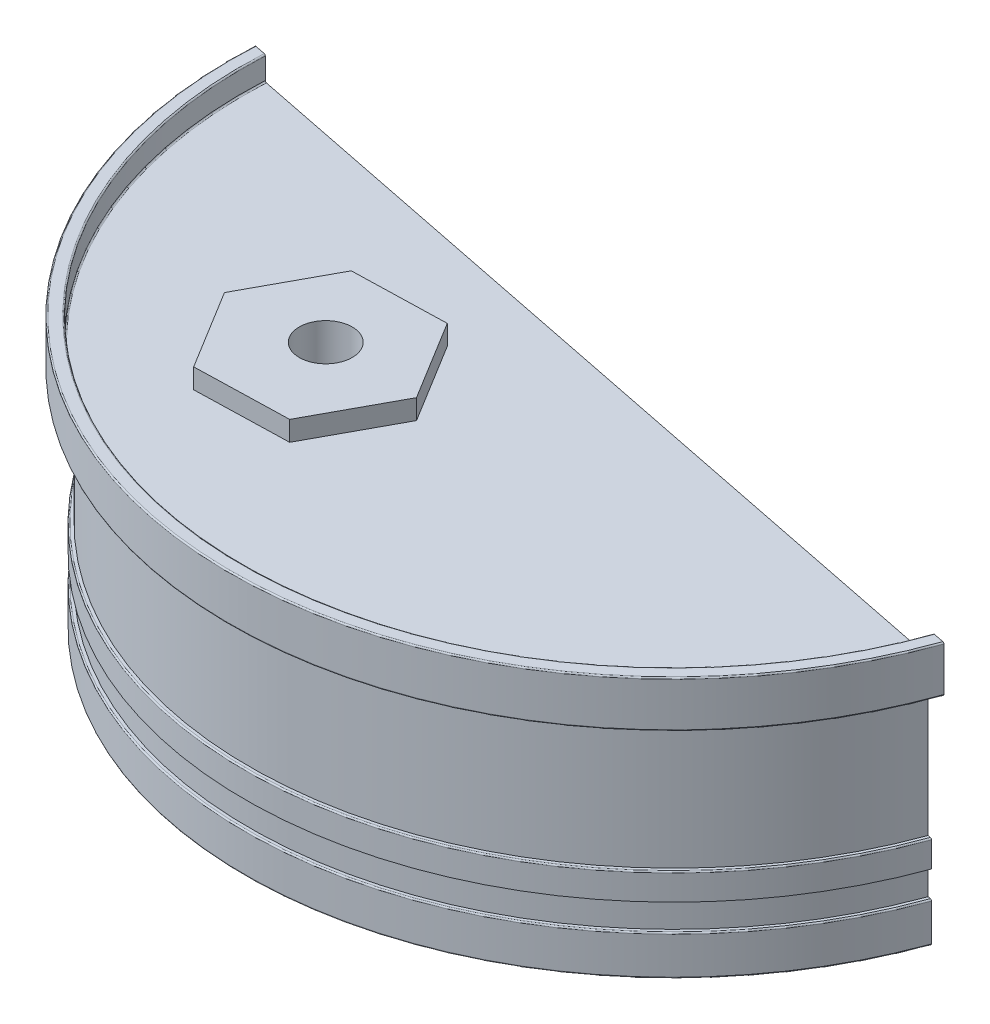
ISO-10303-21;
HEADER;
FILE_DESCRIPTION(('STEP AP214'),'2;1');
FILE_NAME('part.step','',(''),(''),'','','');
FILE_SCHEMA(('AUTOMOTIVE_DESIGN { 1 0 10303 214 1 1 1 1 }'));
ENDSEC;
DATA;
#1=APPLICATION_CONTEXT('core data for automotive mechanical design processes');
#2=APPLICATION_PROTOCOL_DEFINITION('international standard','automotive_design',2000,#1);
#3=PRODUCT_CONTEXT('',#1,'mechanical');
#4=PRODUCT('Part','Part','',(#3));
#5=PRODUCT_RELATED_PRODUCT_CATEGORY('part','',(#4));
#6=PRODUCT_DEFINITION_FORMATION('','',#4);
#7=PRODUCT_DEFINITION_CONTEXT('part definition',#1,'design');
#8=PRODUCT_DEFINITION('design','',#6,#7);
#9=PRODUCT_DEFINITION_SHAPE('','',#8);
#10=(LENGTH_UNIT() NAMED_UNIT(*) SI_UNIT(.MILLI.,.METRE.));
#11=(NAMED_UNIT(*) PLANE_ANGLE_UNIT() SI_UNIT($,.RADIAN.));
#12=(NAMED_UNIT(*) SI_UNIT($,.STERADIAN.) SOLID_ANGLE_UNIT());
#13=UNCERTAINTY_MEASURE_WITH_UNIT(LENGTH_MEASURE(1.E-05),#10,'distance_accuracy_value','');
#14=(GEOMETRIC_REPRESENTATION_CONTEXT(3) GLOBAL_UNCERTAINTY_ASSIGNED_CONTEXT((#13)) GLOBAL_UNIT_ASSIGNED_CONTEXT((#10,
#11,#12)) REPRESENTATION_CONTEXT('',''));
#15=CARTESIAN_POINT('',(0.,0.,0.));
#16=DIRECTION('',(0.,0.,1.));
#17=DIRECTION('',(1.,0.,0.));
#18=AXIS2_PLACEMENT_3D('',#15,#16,#17);
#19=CARTESIAN_POINT('',(0.,0.,0.));
#20=DIRECTION('',(0.,1.,0.));
#21=DIRECTION('',(0.,0.,1.));
#22=AXIS2_PLACEMENT_3D('',#19,#20,#21);
#23=PLANE('',#22);
#24=DIRECTION('',(0.980518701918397,0.,0.196425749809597));
#25=VECTOR('',#24,1.);
#26=CARTESIAN_POINT('',(-9.36010504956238,0.,46.7238030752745));
#27=LINE('',#26,#25);
#28=CARTESIAN_POINT('',(-323.593440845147,-5.58988492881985E-12,-16.2260605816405));
#29=VERTEX_POINT('',#28);
#30=CARTESIAN_POINT('',(304.873230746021,0.,109.673666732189));
#31=VERTEX_POINT('',#30);
#32=EDGE_CURVE('E466',#29,#31,#27,.T.);
#33=ORIENTED_EDGE('',*,*,#32,.F.);
#34=CARTESIAN_POINT('',(0.,0.,0.));
#35=DIRECTION('',(0.,1.,0.));
#36=DIRECTION('',(0.,0.,1.));
#37=AXIS2_PLACEMENT_3D('',#34,#35,#36);
#38=CIRCLE('',#37,324.);
#39=EDGE_CURVE('E228',#29,#31,#38,.T.);
#40=ORIENTED_EDGE('',*,*,#39,.T.);
#41=EDGE_LOOP('',(#33,#40));
#42=FACE_BOUND('',#41,.T.);
#43=DIRECTION('',(0.476481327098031,0.,-0.879184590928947));
#44=VECTOR('',#43,1.);
#45=CARTESIAN_POINT('',(-79.8929721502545,0.,209.849177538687));
#46=LINE('',#45,#44);
#47=CARTESIAN_POINT('',(-79.8929721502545,0.,209.849177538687));
#48=VERTEX_POINT('',#47);
#49=CARTESIAN_POINT('',(-46.2628040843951,0.,147.796115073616));
#50=VERTEX_POINT('',#49);
#51=EDGE_CURVE('E405',#48,#50,#46,.T.);
#52=ORIENTED_EDGE('',*,*,#51,.F.);
#53=DIRECTION('',(0.999636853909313,0.,-0.0269473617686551));
#54=VECTOR('',#53,1.);
#55=CARTESIAN_POINT('',(-150.447584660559,0.,211.751128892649));
#56=LINE('',#55,#54);
#57=CARTESIAN_POINT('',(-150.447584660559,0.,211.751128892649));
#58=VERTEX_POINT('',#57);
#59=EDGE_CURVE('E402',#58,#48,#56,.T.);
#60=ORIENTED_EDGE('',*,*,#59,.F.);
#61=DIRECTION('',(0.523155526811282,0.,0.852237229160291));
#62=VECTOR('',#61,1.);
#63=CARTESIAN_POINT('',(-187.372029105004,0.,151.600017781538));
#64=LINE('',#63,#62);
#65=CARTESIAN_POINT('',(-187.372029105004,0.,151.600017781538));
#66=VERTEX_POINT('',#65);
#67=EDGE_CURVE('E413',#66,#58,#64,.T.);
#68=ORIENTED_EDGE('',*,*,#67,.F.);
#69=DIRECTION('',(-0.476481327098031,0.,0.879184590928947));
#70=VECTOR('',#69,1.);
#71=CARTESIAN_POINT('',(-153.741861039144,0.,89.5469553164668));
#72=LINE('',#71,#70);
#73=CARTESIAN_POINT('',(-153.741861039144,0.,89.5469553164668));
#74=VERTEX_POINT('',#73);
#75=EDGE_CURVE('E411',#74,#66,#72,.T.);
#76=ORIENTED_EDGE('',*,*,#75,.F.);
#77=DIRECTION('',(-0.999636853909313,0.,0.0269473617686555));
#78=VECTOR('',#77,1.);
#79=CARTESIAN_POINT('',(-83.18724852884,0.,87.6450039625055));
#80=LINE('',#79,#78);
#81=CARTESIAN_POINT('',(-83.18724852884,0.,87.6450039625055));
#82=VERTEX_POINT('',#81);
#83=EDGE_CURVE('E409',#82,#74,#80,.T.);
#84=ORIENTED_EDGE('',*,*,#83,.F.);
#85=DIRECTION('',(-0.523155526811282,0.,-0.852237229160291));
#86=VECTOR('',#85,1.);
#87=CARTESIAN_POINT('',(-46.2628040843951,0.,147.796115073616));
#88=LINE('',#87,#86);
#89=EDGE_CURVE('E407',#50,#82,#88,.T.);
#90=ORIENTED_EDGE('',*,*,#89,.F.);
#91=EDGE_LOOP('',(#52,#60,#68,#76,#84,#90));
#92=FACE_BOUND('',#91,.T.);
#93=ADVANCED_FACE('F30',(#42,#92),#23,.T.);
#94=CARTESIAN_POINT('',(-323.178471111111,-187.,0.));
#95=DIRECTION('',(0.,-1.,0.));
#96=DIRECTION('',(0.,0.,-1.));
#97=AXIS2_PLACEMENT_3D('',#94,#95,#96);
#98=PLANE('',#97);
#99=DIRECTION('',(0.980518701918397,0.,0.196425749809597));
#100=VECTOR('',#99,1.);
#101=CARTESIAN_POINT('',(357.92888888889,-187.,120.302222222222));
#102=LINE('',#101,#100);
#103=CARTESIAN_POINT('',(-321.78764883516,-187.,-15.8643091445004));
#104=VERTEX_POINT('',#103);
#105=CARTESIAN_POINT('',(303.067438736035,-187.,109.311915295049));
#106=VERTEX_POINT('',#105);
#107=EDGE_CURVE('E221',#104,#106,#102,.T.);
#108=ORIENTED_EDGE('',*,*,#107,.T.);
#109=CARTESIAN_POINT('',(0.,-187.,0.));
#110=DIRECTION('',(0.,-1.,0.));
#111=DIRECTION('',(0.,0.,-1.));
#112=AXIS2_PLACEMENT_3D('',#109,#110,#111);
#113=CIRCLE('',#112,322.178471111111);
#114=EDGE_CURVE('E243',#106,#104,#113,.T.);
#115=ORIENTED_EDGE('',*,*,#114,.T.);
#116=EDGE_LOOP('',(#108,#115));
#117=FACE_BOUND('',#116,.T.);
#118=ADVANCED_FACE('F515',(#117),#98,.T.);
#119=CARTESIAN_POINT('',(0.,62.5446363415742,0.));
#120=DIRECTION('',(0.,1.,0.));
#121=DIRECTION('',(0.,0.,1.));
#122=AXIS2_PLACEMENT_3D('',#119,#120,#121);
#123=CYLINDRICAL_SURFACE('',#122,323.178471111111);
#124=DIRECTION('',(0.,1.,0.));
#125=VECTOR('',#124,1.);
#126=CARTESIAN_POINT('',(304.058827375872,62.5446363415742,109.510518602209));
#127=LINE('',#126,#125);
#128=CARTESIAN_POINT('',(304.058827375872,-158.,109.510518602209));
#129=VERTEX_POINT('',#128);
#130=CARTESIAN_POINT('',(304.058827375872,-186.,109.510518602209));
#131=VERTEX_POINT('',#130);
#132=EDGE_CURVE('E467',#129,#131,#127,.F.);
#133=ORIENTED_EDGE('',*,*,#132,.F.);
#134=CARTESIAN_POINT('',(0.,-158.,0.));
#135=DIRECTION('',(0.,1.,0.));
#136=DIRECTION('',(0.,0.,1.));
#137=AXIS2_PLACEMENT_3D('',#134,#135,#136);
#138=CIRCLE('',#137,323.178471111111);
#139=CARTESIAN_POINT('',(-322.779037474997,-158.,-16.0629124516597));
#140=VERTEX_POINT('',#139);
#141=EDGE_CURVE('E237',#129,#140,#138,.F.);
#142=ORIENTED_EDGE('',*,*,#141,.T.);
#143=DIRECTION('',(0.,1.,0.));
#144=VECTOR('',#143,1.);
#145=CARTESIAN_POINT('',(-322.779037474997,62.5446363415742,-16.0629124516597));
#146=LINE('',#145,#144);
#147=CARTESIAN_POINT('',(-322.779037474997,-186.,-16.0629124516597));
#148=VERTEX_POINT('',#147);
#149=EDGE_CURVE('E481',#148,#140,#146,.T.);
#150=ORIENTED_EDGE('',*,*,#149,.F.);
#151=CARTESIAN_POINT('',(0.,-186.,0.));
#152=DIRECTION('',(0.,-1.,0.));
#153=DIRECTION('',(0.,0.,-1.));
#154=AXIS2_PLACEMENT_3D('',#151,#152,#153);
#155=CIRCLE('',#154,323.178471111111);
#156=EDGE_CURVE('E240',#148,#131,#155,.F.);
#157=ORIENTED_EDGE('',*,*,#156,.T.);
#158=EDGE_LOOP('',(#133,#142,#150,#157));
#159=FACE_BOUND('',#158,.T.);
#160=ADVANCED_FACE('F596',(#159),#123,.T.);
#161=CARTESIAN_POINT('',(-320.,-157.,0.));
#162=DIRECTION('',(0.,1.,0.));
#163=DIRECTION('',(0.,0.,1.));
#164=AXIS2_PLACEMENT_3D('',#161,#162,#163);
#165=PLANE('',#164);
#166=DIRECTION('',(0.980518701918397,0.,0.196425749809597));
#167=VECTOR('',#166,1.);
#168=CARTESIAN_POINT('',(-317.013520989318,-157.,-14.9079157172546));
#169=LINE('',#168,#167);
#170=CARTESIAN_POINT('',(-321.78764883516,-157.,-15.8643091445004));
#171=VERTEX_POINT('',#170);
#172=CARTESIAN_POINT('',(-319.627698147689,-157.,-15.4316096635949));
#173=VERTEX_POINT('',#172);
#174=EDGE_CURVE('E474',#171,#173,#169,.T.);
#175=ORIENTED_EDGE('',*,*,#174,.F.);
#176=CARTESIAN_POINT('',(0.,-157.,0.));
#177=DIRECTION('',(0.,1.,0.));
#178=DIRECTION('',(0.,0.,1.));
#179=AXIS2_PLACEMENT_3D('',#176,#177,#178);
#180=CIRCLE('',#179,322.178471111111);
#181=CARTESIAN_POINT('',(303.067438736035,-157.,109.311915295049));
#182=VERTEX_POINT('',#181);
#183=EDGE_CURVE('E246',#171,#182,#180,.T.);
#184=ORIENTED_EDGE('',*,*,#183,.T.);
#185=CARTESIAN_POINT('',(300.907488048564,-157.,108.879215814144));
#186=VERTEX_POINT('',#185);
#187=EDGE_CURVE('E471',#186,#182,#169,.T.);
#188=ORIENTED_EDGE('',*,*,#187,.F.);
#189=CARTESIAN_POINT('',(0.,-157.,0.));
#190=DIRECTION('',(0.,1.,0.));
#191=DIRECTION('',(0.,0.,1.));
#192=AXIS2_PLACEMENT_3D('',#189,#190,#191);
#193=CIRCLE('',#192,320.);
#194=EDGE_CURVE('E452',#173,#186,#193,.T.);
#195=ORIENTED_EDGE('',*,*,#194,.F.);
#196=EDGE_LOOP('',(#175,#184,#188,#195));
#197=FACE_BOUND('',#196,.T.);
#198=ADVANCED_FACE('F632',(#197),#165,.T.);
#199=CARTESIAN_POINT('',(0.,62.5446363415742,0.));
#200=DIRECTION('',(0.,1.,0.));
#201=DIRECTION('',(0.,0.,1.));
#202=AXIS2_PLACEMENT_3D('',#199,#200,#201);
#203=CYLINDRICAL_SURFACE('',#202,320.);
#204=DIRECTION('',(0.,1.,0.));
#205=VECTOR('',#204,1.);
#206=CARTESIAN_POINT('',(300.907488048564,62.5446363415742,108.879215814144));
#207=LINE('',#206,#205);
#208=CARTESIAN_POINT('',(300.907488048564,-137.,108.879215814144));
#209=VERTEX_POINT('',#208);
#210=EDGE_CURVE('E473',#209,#186,#207,.F.);
#211=ORIENTED_EDGE('',*,*,#210,.F.);
#212=CARTESIAN_POINT('',(0.,-137.,0.));
#213=DIRECTION('',(0.,1.,0.));
#214=DIRECTION('',(0.,0.,1.));
#215=AXIS2_PLACEMENT_3D('',#212,#213,#214);
#216=CIRCLE('',#215,320.);
#217=CARTESIAN_POINT('',(-319.627698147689,-137.,-15.4316096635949));
#218=VERTEX_POINT('',#217);
#219=EDGE_CURVE('E449',#218,#209,#216,.T.);
#220=ORIENTED_EDGE('',*,*,#219,.F.);
#221=DIRECTION('',(0.,1.,0.));
#222=VECTOR('',#221,1.);
#223=CARTESIAN_POINT('',(-319.627698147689,62.5446363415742,-15.4316096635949));
#224=LINE('',#223,#222);
#225=EDGE_CURVE('E478',#173,#218,#224,.T.);
#226=ORIENTED_EDGE('',*,*,#225,.F.);
#227=ORIENTED_EDGE('',*,*,#194,.T.);
#228=EDGE_LOOP('',(#211,#220,#226,#227));
#229=FACE_BOUND('',#228,.T.);
#230=ADVANCED_FACE('F628',(#229),#203,.T.);
#231=CARTESIAN_POINT('',(-323.178471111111,-137.,0.));
#232=DIRECTION('',(0.,-1.,0.));
#233=DIRECTION('',(0.,0.,-1.));
#234=AXIS2_PLACEMENT_3D('',#231,#232,#233);
#235=PLANE('',#234);
#236=DIRECTION('',(-0.980518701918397,0.,-0.196425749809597));
#237=VECTOR('',#236,1.);
#238=CARTESIAN_POINT('',(-320.069356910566,-137.,-15.5200864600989));
#239=LINE('',#238,#237);
#240=CARTESIAN_POINT('',(304.058827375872,-137.,109.510518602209));
#241=VERTEX_POINT('',#240);
#242=EDGE_CURVE('E476',#241,#209,#239,.T.);
#243=ORIENTED_EDGE('',*,*,#242,.F.);
#244=CARTESIAN_POINT('',(0.,-137.,0.));
#245=DIRECTION('',(0.,1.,0.));
#246=DIRECTION('',(0.,0.,1.));
#247=AXIS2_PLACEMENT_3D('',#244,#245,#246);
#248=CIRCLE('',#247,323.178471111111);
#249=CARTESIAN_POINT('',(-322.779037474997,-137.,-16.0629124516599));
#250=VERTEX_POINT('',#249);
#251=EDGE_CURVE('E446',#250,#241,#248,.T.);
#252=ORIENTED_EDGE('',*,*,#251,.F.);
#253=EDGE_CURVE('E482',#218,#250,#239,.T.);
#254=ORIENTED_EDGE('',*,*,#253,.F.);
#255=ORIENTED_EDGE('',*,*,#219,.T.);
#256=EDGE_LOOP('',(#243,#252,#254,#255));
#257=FACE_BOUND('',#256,.T.);
#258=ADVANCED_FACE('F624',(#257),#235,.T.);
#259=CARTESIAN_POINT('',(0.,62.5446363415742,0.));
#260=DIRECTION('',(0.,1.,0.));
#261=DIRECTION('',(0.,0.,1.));
#262=AXIS2_PLACEMENT_3D('',#259,#260,#261);
#263=CYLINDRICAL_SURFACE('',#262,323.178471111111);
#264=DIRECTION('',(0.,1.,0.));
#265=VECTOR('',#264,1.);
#266=CARTESIAN_POINT('',(304.058827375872,62.5446363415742,109.510518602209));
#267=LINE('',#266,#265);
#268=CARTESIAN_POINT('',(304.058827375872,-118.,109.510518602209));
#269=VERTEX_POINT('',#268);
#270=EDGE_CURVE('E496',#269,#241,#267,.F.);
#271=ORIENTED_EDGE('',*,*,#270,.F.);
#272=CARTESIAN_POINT('',(0.,-118.,0.));
#273=DIRECTION('',(0.,1.,0.));
#274=DIRECTION('',(0.,0.,1.));
#275=AXIS2_PLACEMENT_3D('',#272,#273,#274);
#276=CIRCLE('',#275,323.178471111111);
#277=CARTESIAN_POINT('',(-322.779037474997,-118.,-16.0629124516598));
#278=VERTEX_POINT('',#277);
#279=EDGE_CURVE('E252',#269,#278,#276,.F.);
#280=ORIENTED_EDGE('',*,*,#279,.T.);
#281=DIRECTION('',(0.,1.,0.));
#282=VECTOR('',#281,1.);
#283=CARTESIAN_POINT('',(-322.779037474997,62.5446363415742,-16.0629124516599));
#284=LINE('',#283,#282);
#285=EDGE_CURVE('E484',#250,#278,#284,.T.);
#286=ORIENTED_EDGE('',*,*,#285,.F.);
#287=ORIENTED_EDGE('',*,*,#251,.T.);
#288=EDGE_LOOP('',(#271,#280,#286,#287));
#289=FACE_BOUND('',#288,.T.);
#290=ADVANCED_FACE('F620',(#289),#263,.T.);
#291=CARTESIAN_POINT('',(-320.,-117.,0.));
#292=DIRECTION('',(0.,1.,0.));
#293=DIRECTION('',(0.,0.,1.));
#294=AXIS2_PLACEMENT_3D('',#291,#292,#293);
#295=PLANE('',#294);
#296=DIRECTION('',(0.980518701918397,0.,0.196425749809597));
#297=VECTOR('',#296,1.);
#298=CARTESIAN_POINT('',(-317.013520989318,-117.,-14.9079157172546));
#299=LINE('',#298,#297);
#300=CARTESIAN_POINT('',(-321.787648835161,-117.,-15.8643091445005));
#301=VERTEX_POINT('',#300);
#302=CARTESIAN_POINT('',(-319.627698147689,-117.,-15.4316096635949));
#303=VERTEX_POINT('',#302);
#304=EDGE_CURVE('E488',#301,#303,#299,.T.);
#305=ORIENTED_EDGE('',*,*,#304,.F.);
#306=CARTESIAN_POINT('',(0.,-117.,0.));
#307=DIRECTION('',(0.,1.,0.));
#308=DIRECTION('',(0.,0.,1.));
#309=AXIS2_PLACEMENT_3D('',#306,#307,#308);
#310=CIRCLE('',#309,322.178471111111);
#311=CARTESIAN_POINT('',(303.067438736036,-117.,109.31191529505));
#312=VERTEX_POINT('',#311);
#313=EDGE_CURVE('E249',#301,#312,#310,.T.);
#314=ORIENTED_EDGE('',*,*,#313,.T.);
#315=CARTESIAN_POINT('',(300.907488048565,-117.,108.879215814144));
#316=VERTEX_POINT('',#315);
#317=EDGE_CURVE('E491',#316,#312,#299,.T.);
#318=ORIENTED_EDGE('',*,*,#317,.F.);
#319=CARTESIAN_POINT('',(0.,-117.,0.));
#320=DIRECTION('',(0.,1.,0.));
#321=DIRECTION('',(0.,0.,1.));
#322=AXIS2_PLACEMENT_3D('',#319,#320,#321);
#323=CIRCLE('',#322,320.);
#324=EDGE_CURVE('E443',#303,#316,#323,.T.);
#325=ORIENTED_EDGE('',*,*,#324,.F.);
#326=EDGE_LOOP('',(#305,#314,#318,#325));
#327=FACE_BOUND('',#326,.T.);
#328=ADVANCED_FACE('F616',(#327),#295,.T.);
#329=CARTESIAN_POINT('',(0.,62.5446363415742,0.));
#330=DIRECTION('',(0.,1.,0.));
#331=DIRECTION('',(0.,0.,1.));
#332=AXIS2_PLACEMENT_3D('',#329,#330,#331);
#333=CYLINDRICAL_SURFACE('',#332,320.);
#334=DIRECTION('',(0.,1.,0.));
#335=VECTOR('',#334,1.);
#336=CARTESIAN_POINT('',(300.907488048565,62.5446363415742,108.879215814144));
#337=LINE('',#336,#335);
#338=CARTESIAN_POINT('',(300.907488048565,-18.,108.879215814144));
#339=VERTEX_POINT('',#338);
#340=EDGE_CURVE('E493',#339,#316,#337,.F.);
#341=ORIENTED_EDGE('',*,*,#340,.F.);
#342=CARTESIAN_POINT('',(0.,-18.,0.));
#343=DIRECTION('',(0.,-1.,0.));
#344=DIRECTION('',(0.,0.,-1.));
#345=AXIS2_PLACEMENT_3D('',#342,#343,#344);
#346=CIRCLE('',#345,320.);
#347=CARTESIAN_POINT('',(-319.627698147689,-18.,-15.4316096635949));
#348=VERTEX_POINT('',#347);
#349=EDGE_CURVE('E261',#339,#348,#346,.T.);
#350=ORIENTED_EDGE('',*,*,#349,.T.);
#351=DIRECTION('',(0.,1.,0.));
#352=VECTOR('',#351,1.);
#353=CARTESIAN_POINT('',(-319.627698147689,62.5446363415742,-15.4316096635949));
#354=LINE('',#353,#352);
#355=EDGE_CURVE('E490',#303,#348,#354,.T.);
#356=ORIENTED_EDGE('',*,*,#355,.F.);
#357=ORIENTED_EDGE('',*,*,#324,.T.);
#358=EDGE_LOOP('',(#341,#350,#356,#357));
#359=FACE_BOUND('',#358,.T.);
#360=ADVANCED_FACE('F610',(#359),#333,.T.);
#361=CARTESIAN_POINT('',(-335.,-17.,0.));
#362=DIRECTION('',(0.,-1.,0.));
#363=DIRECTION('',(0.,0.,-1.));
#364=AXIS2_PLACEMENT_3D('',#361,#362,#363);
#365=PLANE('',#364);
#366=DIRECTION('',(-0.980518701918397,0.,-0.196425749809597));
#367=VECTOR('',#366,1.);
#368=CARTESIAN_POINT('',(-331.434774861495,-17.,-17.7969025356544));
#369=LINE('',#368,#367);
#370=CARTESIAN_POINT('',(314.78293851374,-17.0000000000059,111.658862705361));
#371=VERTEX_POINT('',#370);
#372=CARTESIAN_POINT('',(301.899027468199,-17.,109.07784932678));
#373=VERTEX_POINT('',#372);
#374=EDGE_CURVE('E499',#371,#373,#369,.T.);
#375=ORIENTED_EDGE('',*,*,#374,.F.);
#376=CARTESIAN_POINT('',(0.,-17.,0.));
#377=DIRECTION('',(0.,-1.,0.));
#378=DIRECTION('',(0.,0.,-1.));
#379=AXIS2_PLACEMENT_3D('',#376,#377,#378);
#380=CIRCLE('',#379,334.);
#381=CARTESIAN_POINT('',(-333.503148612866,-17.0000000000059,-18.2112565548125));
#382=VERTEX_POINT('',#381);
#383=EDGE_CURVE('E255',#371,#382,#380,.T.);
#384=ORIENTED_EDGE('',*,*,#383,.T.);
#385=CARTESIAN_POINT('',(-320.619237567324,-17.,-15.630243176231));
#386=VERTEX_POINT('',#385);
#387=EDGE_CURVE('E503',#386,#382,#369,.T.);
#388=ORIENTED_EDGE('',*,*,#387,.F.);
#389=CARTESIAN_POINT('',(0.,-17.,0.));
#390=DIRECTION('',(0.,-1.,0.));
#391=DIRECTION('',(0.,0.,-1.));
#392=AXIS2_PLACEMENT_3D('',#389,#390,#391);
#393=CIRCLE('',#392,321.);
#394=EDGE_CURVE('E258',#386,#373,#393,.F.);
#395=ORIENTED_EDGE('',*,*,#394,.T.);
#396=EDGE_LOOP('',(#375,#384,#388,#395));
#397=FACE_BOUND('',#396,.T.);
#398=ADVANCED_FACE('F604',(#397),#365,.T.);
#399=CARTESIAN_POINT('',(0.,62.5446363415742,0.));
#400=DIRECTION('',(0.,1.,0.));
#401=DIRECTION('',(0.,0.,1.));
#402=AXIS2_PLACEMENT_3D('',#399,#400,#401);
#403=CYLINDRICAL_SURFACE('',#402,335.);
#404=DIRECTION('',(0.,1.,0.));
#405=VECTOR('',#404,1.);
#406=CARTESIAN_POINT('',(315.773560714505,62.5446363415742,111.857312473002));
#407=LINE('',#406,#405);
#408=CARTESIAN_POINT('',(315.773560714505,17.,111.857312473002));
#409=VERTEX_POINT('',#408);
#410=CARTESIAN_POINT('',(315.773560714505,-16.,111.857312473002));
#411=VERTEX_POINT('',#410);
#412=EDGE_CURVE('E505',#409,#411,#407,.F.);
#413=ORIENTED_EDGE('',*,*,#412,.F.);
#414=CARTESIAN_POINT('',(0.,17.,0.));
#415=DIRECTION('',(0.,1.,0.));
#416=DIRECTION('',(0.,0.,1.));
#417=AXIS2_PLACEMENT_3D('',#414,#415,#416);
#418=CIRCLE('',#417,335.);
#419=CARTESIAN_POINT('',(-334.49377081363,17.,-18.4097063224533));
#420=VERTEX_POINT('',#419);
#421=EDGE_CURVE('E264',#409,#420,#418,.F.);
#422=ORIENTED_EDGE('',*,*,#421,.T.);
#423=DIRECTION('',(0.,1.,0.));
#424=VECTOR('',#423,1.);
#425=CARTESIAN_POINT('',(-334.49377081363,62.5446363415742,-18.4097063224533));
#426=LINE('',#425,#424);
#427=CARTESIAN_POINT('',(-334.49377081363,-16.,-18.4097063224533));
#428=VERTEX_POINT('',#427);
#429=EDGE_CURVE('E49',#428,#420,#426,.T.);
#430=ORIENTED_EDGE('',*,*,#429,.F.);
#431=CARTESIAN_POINT('',(0.,-16.,0.));
#432=DIRECTION('',(0.,-1.,0.));
#433=DIRECTION('',(0.,0.,-1.));
#434=AXIS2_PLACEMENT_3D('',#431,#432,#433);
#435=CIRCLE('',#434,335.);
#436=EDGE_CURVE('E212',#428,#411,#435,.F.);
#437=ORIENTED_EDGE('',*,*,#436,.T.);
#438=EDGE_LOOP('',(#413,#422,#430,#437));
#439=FACE_BOUND('',#438,.T.);
#440=ADVANCED_FACE('F602',(#439),#403,.T.);
#441=CARTESIAN_POINT('',(-325.,18.,0.));
#442=DIRECTION('',(0.,1.,0.));
#443=DIRECTION('',(0.,0.,1.));
#444=AXIS2_PLACEMENT_3D('',#441,#442,#443);
#445=PLANE('',#444);
#446=DIRECTION('',(0.980518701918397,0.,0.196425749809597));
#447=VECTOR('',#446,1.);
#448=CARTESIAN_POINT('',(357.92888888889,18.,120.302222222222));
#449=LINE('',#448,#447);
#450=CARTESIAN_POINT('',(-333.503148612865,18.,-18.2112565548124));
#451=VERTEX_POINT('',#450);
#452=CARTESIAN_POINT('',(-325.575903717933,18.,-16.6232042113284));
#453=VERTEX_POINT('',#452);
#454=EDGE_CURVE('E206',#451,#453,#449,.T.);
#455=ORIENTED_EDGE('',*,*,#454,.F.);
#456=CARTESIAN_POINT('',(0.,18.,0.));
#457=DIRECTION('',(0.,1.,0.));
#458=DIRECTION('',(0.,0.,1.));
#459=AXIS2_PLACEMENT_3D('',#456,#457,#458);
#460=CIRCLE('',#459,334.);
#461=CARTESIAN_POINT('',(314.78293851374,18.,111.658862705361));
#462=VERTEX_POINT('',#461);
#463=EDGE_CURVE('E218',#451,#462,#460,.T.);
#464=ORIENTED_EDGE('',*,*,#463,.T.);
#465=CARTESIAN_POINT('',(306.855693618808,18.,110.070810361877));
#466=VERTEX_POINT('',#465);
#467=EDGE_CURVE('E222',#466,#462,#449,.T.);
#468=ORIENTED_EDGE('',*,*,#467,.F.);
#469=CARTESIAN_POINT('',(0.,18.,0.));
#470=DIRECTION('',(0.,1.,0.));
#471=DIRECTION('',(0.,0.,1.));
#472=AXIS2_PLACEMENT_3D('',#469,#470,#471);
#473=CIRCLE('',#472,326.);
#474=EDGE_CURVE('E220',#466,#453,#473,.F.);
#475=ORIENTED_EDGE('',*,*,#474,.T.);
#476=EDGE_LOOP('',(#455,#464,#468,#475));
#477=FACE_BOUND('',#476,.T.);
#478=ADVANCED_FACE('F216',(#477),#445,.T.);
#479=CARTESIAN_POINT('',(0.,62.5446363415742,0.));
#480=DIRECTION('',(0.,1.,0.));
#481=DIRECTION('',(0.,0.,1.));
#482=AXIS2_PLACEMENT_3D('',#479,#480,#481);
#483=CYLINDRICAL_SURFACE('',#482,325.);
#484=DIRECTION('',(0.,1.,0.));
#485=VECTOR('',#484,1.);
#486=CARTESIAN_POINT('',(305.864495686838,62.5446363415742,109.872245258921));
#487=LINE('',#486,#485);
#488=CARTESIAN_POINT('',(305.864495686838,0.99999999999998,109.872245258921));
#489=VERTEX_POINT('',#488);
#490=CARTESIAN_POINT('',(305.864495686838,17.,109.872245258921));
#491=VERTEX_POINT('',#490);
#492=EDGE_CURVE('E380',#489,#491,#487,.T.);
#493=ORIENTED_EDGE('',*,*,#492,.F.);
#494=CARTESIAN_POINT('',(0.,0.99999999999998,0.));
#495=DIRECTION('',(0.,1.,0.));
#496=DIRECTION('',(0.,0.,1.));
#497=AXIS2_PLACEMENT_3D('',#494,#495,#496);
#498=CIRCLE('',#497,325.);
#499=CARTESIAN_POINT('',(-324.584705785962,0.99999999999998,-16.4246391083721));
#500=VERTEX_POINT('',#499);
#501=EDGE_CURVE('E231',#489,#500,#498,.F.);
#502=ORIENTED_EDGE('',*,*,#501,.T.);
#503=DIRECTION('',(0.,1.,0.));
#504=VECTOR('',#503,1.);
#505=CARTESIAN_POINT('',(-324.584705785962,62.5446363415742,-16.4246391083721));
#506=LINE('',#505,#504);
#507=CARTESIAN_POINT('',(-324.584705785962,17.,-16.4246391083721));
#508=VERTEX_POINT('',#507);
#509=EDGE_CURVE('E459',#508,#500,#506,.F.);
#510=ORIENTED_EDGE('',*,*,#509,.F.);
#511=CARTESIAN_POINT('',(0.,17.,0.));
#512=DIRECTION('',(0.,1.,0.));
#513=DIRECTION('',(0.,0.,1.));
#514=AXIS2_PLACEMENT_3D('',#511,#512,#513);
#515=CIRCLE('',#514,325.);
#516=EDGE_CURVE('E226',#508,#491,#515,.T.);
#517=ORIENTED_EDGE('',*,*,#516,.T.);
#518=EDGE_LOOP('',(#493,#502,#510,#517));
#519=FACE_BOUND('',#518,.T.);
#520=ADVANCED_FACE('F386',(#519),#483,.F.);
#521=CARTESIAN_POINT('',(0.,17.,0.));
#522=DIRECTION('',(0.,1.,0.));
#523=DIRECTION('',(0.,0.,1.));
#524=AXIS2_PLACEMENT_3D('',#521,#522,#523);
#525=TOROIDAL_SURFACE('',#524,326.,1.);
#526=CARTESIAN_POINT('',(305.864495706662,16.9998,109.872245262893));
#527=CARTESIAN_POINT('',(305.864490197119,17.0277133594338,109.872244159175));
#528=CARTESIAN_POINT('',(305.865643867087,17.0556135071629,109.872475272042));
#529=CARTESIAN_POINT('',(305.870256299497,17.1112129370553,109.87339927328));
#530=CARTESIAN_POINT('',(305.873714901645,17.1389122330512,109.874092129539));
#531=CARTESIAN_POINT('',(305.887510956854,17.2213485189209,109.876855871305));
#532=CARTESIAN_POINT('',(305.901268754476,17.2755312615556,109.87961194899));
#533=CARTESIAN_POINT('',(305.937498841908,17.3807652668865,109.886869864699));
#534=CARTESIAN_POINT('',(305.959974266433,17.4318153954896,109.891372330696));
#535=CARTESIAN_POINT('',(306.01296923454,17.5293683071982,109.901988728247));
#536=CARTESIAN_POINT('',(306.043487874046,17.5758716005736,109.90810247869));
#537=CARTESIAN_POINT('',(306.111840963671,17.6632619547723,109.921795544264));
#538=CARTESIAN_POINT('',(306.149709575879,17.7041212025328,109.929381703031));
#539=CARTESIAN_POINT('',(306.231580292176,17.7788624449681,109.945782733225));
#540=CARTESIAN_POINT('',(306.275583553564,17.8127431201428,109.954597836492));
#541=CARTESIAN_POINT('',(306.368948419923,17.8729258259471,109.97330147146));
#542=CARTESIAN_POINT('',(306.418360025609,17.8991471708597,109.983200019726));
#543=CARTESIAN_POINT('',(306.520765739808,17.9428485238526,110.003714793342));
#544=CARTESIAN_POINT('',(306.573759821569,17.9603285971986,110.014331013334));
#545=CARTESIAN_POINT('',(306.682377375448,17.9862169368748,110.036090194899));
#546=CARTESIAN_POINT('',(306.738021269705,17.9945361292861,110.047237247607));
#547=CARTESIAN_POINT('',(306.849892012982,18.0015804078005,110.069648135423));
#548=CARTESIAN_POINT('',(306.906118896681,18.0003049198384,110.080911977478));
#549=CARTESIAN_POINT('',(307.017845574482,17.9881621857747,110.103294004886));
#550=CARTESIAN_POINT('',(307.073340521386,17.9772484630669,110.114411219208));
#551=CARTESIAN_POINT('',(307.181740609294,17.9460554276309,110.136126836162));
#552=CARTESIAN_POINT('',(307.234645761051,17.9257761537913,110.146725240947));
#553=CARTESIAN_POINT('',(307.33623831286,17.8764486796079,110.167077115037));
#554=CARTESIAN_POINT('',(307.384934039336,17.8474183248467,110.176832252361));
#555=CARTESIAN_POINT('',(307.476802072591,17.7813689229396,110.195236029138));
#556=CARTESIAN_POINT('',(307.519974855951,17.7443505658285,110.203884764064));
#557=CARTESIAN_POINT('',(307.599186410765,17.6636930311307,110.219753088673));
#558=CARTESIAN_POINT('',(307.635280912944,17.6201107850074,110.226983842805));
#559=CARTESIAN_POINT('',(307.69970364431,17.5273119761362,110.239889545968));
#560=CARTESIAN_POINT('',(307.72802983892,17.4780939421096,110.245564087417));
#561=CARTESIAN_POINT('',(307.775797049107,17.3759717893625,110.255133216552));
#562=CARTESIAN_POINT('',(307.795323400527,17.3231090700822,110.25904489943));
#563=CARTESIAN_POINT('',(307.825284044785,17.2148164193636,110.265046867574));
#564=CARTESIAN_POINT('',(307.835732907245,17.1593907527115,110.267140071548));
#565=CARTESIAN_POINT('',(307.843278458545,17.0862952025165,110.268651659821));
#566=CARTESIAN_POINT('',(307.844612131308,17.069009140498,110.268918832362));
#567=CARTESIAN_POINT('',(307.846385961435,17.0344177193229,110.269274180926));
#568=CARTESIAN_POINT('',(307.846827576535,17.0171124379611,110.269362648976));
#569=CARTESIAN_POINT('',(307.846825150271,16.9998,110.269362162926));
#570=B_SPLINE_CURVE_WITH_KNOTS('',3,(#526,#527,#528,#529,#530,#531,#532,#533,#534,#535,#536,
#537,#538,#539,#540,#541,#542,#543,#544,#545,#546,#547,#548,#549,#550,#551,#552,#553,#554,#555,
#556,#557,#558,#559,#560,#561,#562,#563,#564,#565,#566,#567,#568,#569),.UNSPECIFIED.,.F.,.F.,(4,
2,2,2,2,2,2,2,2,2,2,2,2,2,2,2,2,2,2,2,2,4),(0.,0.0836883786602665,0.167370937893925,
0.334418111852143,0.501525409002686,0.668613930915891,0.836498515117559,1.00441481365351,
1.17404098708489,1.34366589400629,1.51492593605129,1.68619622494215,1.85829693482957,
2.03039693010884,2.20214831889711,2.37388487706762,2.54420959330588,2.71457887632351,
2.88325845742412,3.05166680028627,3.1036687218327,3.15558559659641),.UNSPECIFIED.);
#571=EDGE_CURVE('E391',#491,#466,#570,.T.);
#572=ORIENTED_EDGE('',*,*,#571,.F.);
#573=ORIENTED_EDGE('',*,*,#516,.F.);
#574=CARTESIAN_POINT('',(-326.0002,17.9037386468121,-16.7082028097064));
#575=CARTESIAN_POINT('',(-325.949267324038,17.9281307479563,-16.6979995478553));
#576=CARTESIAN_POINT('',(-325.896291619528,17.9480309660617,-16.6873870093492));
#577=CARTESIAN_POINT('',(-325.787859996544,17.9785021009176,-16.6656650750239));
#578=CARTESIAN_POINT('',(-325.732405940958,17.9890799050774,-16.6545560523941));
#579=CARTESIAN_POINT('',(-325.620524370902,18.0005997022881,-16.6321429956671));
#580=CARTESIAN_POINT('',(-325.564096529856,18.0015383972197,-16.6208388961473));
#581=CARTESIAN_POINT('',(-325.451894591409,17.9937620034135,-16.5983616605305));
#582=CARTESIAN_POINT('',(-325.3961203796,17.9850486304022,-16.5871885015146));
#583=CARTESIAN_POINT('',(-325.286708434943,17.9581765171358,-16.5652701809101));
#584=CARTESIAN_POINT('',(-325.233074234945,17.9400028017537,-16.5545257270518));
#585=CARTESIAN_POINT('',(-325.129567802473,17.8946858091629,-16.5337904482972));
#586=CARTESIAN_POINT('',(-325.079696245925,17.867540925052,-16.523799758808));
#587=CARTESIAN_POINT('',(-324.985398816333,17.8051672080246,-16.5049093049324));
#588=CARTESIAN_POINT('',(-324.940949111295,17.7699758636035,-16.4960047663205));
#589=CARTESIAN_POINT('',(-324.858551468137,17.6924204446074,-16.4794981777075));
#590=CARTESIAN_POINT('',(-324.820602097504,17.6500579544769,-16.4718958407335));
#591=CARTESIAN_POINT('',(-324.752665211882,17.5597869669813,-16.4582861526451));
#592=CARTESIAN_POINT('',(-324.722605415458,17.5119350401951,-16.4522643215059));
#593=CARTESIAN_POINT('',(-324.670881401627,17.4117158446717,-16.4419025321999));
#594=CARTESIAN_POINT('',(-324.649216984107,17.3593486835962,-16.4375625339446));
#595=CARTESIAN_POINT('',(-324.616426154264,17.2562249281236,-16.4309935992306));
#596=CARTESIAN_POINT('',(-324.604558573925,17.2057118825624,-16.4286161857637));
#597=CARTESIAN_POINT('',(-324.588675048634,17.1034056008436,-16.4254342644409));
#598=CARTESIAN_POINT('',(-324.584661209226,17.0516120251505,-16.4246301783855));
#599=CARTESIAN_POINT('',(-324.584705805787,16.9997999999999,-16.4246391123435));
#600=B_SPLINE_CURVE_WITH_KNOTS('',3,(#574,#575,#576,#577,#578,#579,#580,#581,#582,#583,#584,
#585,#586,#587,#588,#589,#590,#591,#592,#593,#594,#595,#596,#597,#598,#599),.UNSPECIFIED.,.F.,
.F.,(4,2,2,2,2,2,2,2,2,2,2,2,4),(0.,0.171922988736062,0.343718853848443,0.515573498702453,
0.687397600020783,0.859494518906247,1.03162228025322,1.20296387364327,1.37426765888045,
1.5439424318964,1.71361316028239,1.86881324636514,2.0240549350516),.UNSPECIFIED.);
#601=EDGE_CURVE('E374',#453,#508,#600,.T.);
#602=ORIENTED_EDGE('',*,*,#601,.F.);
#603=ORIENTED_EDGE('',*,*,#474,.F.);
#604=EDGE_LOOP('',(#572,#573,#602,#603));
#605=FACE_BOUND('',#604,.T.);
#606=ADVANCED_FACE('F381',(#605),#525,.T.);
#607=CARTESIAN_POINT('',(0.,0.99999999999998,0.));
#608=DIRECTION('',(0.,1.,0.));
#609=DIRECTION('',(0.,0.,1.));
#610=AXIS2_PLACEMENT_3D('',#607,#608,#609);
#611=TOROIDAL_SURFACE('',#610,324.,1.);
#612=ORIENTED_EDGE('',*,*,#501,.F.);
#613=CARTESIAN_POINT('',(305.864495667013,1.00019999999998,109.87224525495));
#614=CARTESIAN_POINT('',(305.864501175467,0.972287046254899,109.87224635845));
#615=CARTESIAN_POINT('',(305.863347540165,0.944387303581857,109.872015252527));
#616=CARTESIAN_POINT('',(305.858735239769,0.88878867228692,109.871091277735));
#617=CARTESIAN_POINT('',(305.855276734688,0.861089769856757,109.870398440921));
#618=CARTESIAN_POINT('',(305.841481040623,0.77865457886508,109.867634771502));
#619=CARTESIAN_POINT('',(305.827723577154,0.724472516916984,109.864878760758));
#620=CARTESIAN_POINT('',(305.79149420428,0.619239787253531,109.857620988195));
#621=CARTESIAN_POINT('',(305.769019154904,0.568190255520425,109.853118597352));
#622=CARTESIAN_POINT('',(305.716024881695,0.470638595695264,109.842502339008));
#623=CARTESIAN_POINT('',(305.685506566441,0.424135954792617,109.836388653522));
#624=CARTESIAN_POINT('',(305.617154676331,0.336747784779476,109.822695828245));
#625=CARTESIAN_POINT('',(305.579287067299,0.29588996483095,109.815109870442));
#626=CARTESIAN_POINT('',(305.497418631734,0.221151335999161,109.798709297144));
#627=CARTESIAN_POINT('',(305.453416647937,0.187271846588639,109.789894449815));
#628=CARTESIAN_POINT('',(305.360054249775,0.127090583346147,109.771191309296));
#629=CARTESIAN_POINT('',(305.310643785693,0.100869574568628,109.761292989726));
#630=CARTESIAN_POINT('',(305.208240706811,0.0571677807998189,109.740778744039));
#631=CARTESIAN_POINT('',(305.155248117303,0.0396869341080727,109.730162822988));
#632=CARTESIAN_POINT('',(305.046628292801,0.0137938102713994,109.708403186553));
#633=CARTESIAN_POINT('',(304.990980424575,0.00547151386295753,109.697255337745));
#634=CARTESIAN_POINT('',(304.87910124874,-0.00157985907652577,109.674842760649));
#635=CARTESIAN_POINT('',(304.82286990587,-0.000308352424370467,109.663578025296));
#636=CARTESIAN_POINT('',(304.711124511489,0.0118259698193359,109.641192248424));
#637=CARTESIAN_POINT('',(304.655615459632,0.0227367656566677,109.630072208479));
#638=CARTESIAN_POINT('',(304.547186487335,0.0539254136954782,109.608350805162));
#639=CARTESIAN_POINT('',(304.494266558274,0.07420323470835,109.597749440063));
#640=CARTESIAN_POINT('',(304.39263891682,0.12353202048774,109.57739053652));
#641=CARTESIAN_POINT('',(304.343923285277,0.152566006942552,109.567631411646));
#642=CARTESIAN_POINT('',(304.252016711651,0.21862657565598,109.549219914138));
#643=CARTESIAN_POINT('',(304.20882529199,0.255652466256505,109.540567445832));
#644=CARTESIAN_POINT('',(304.129582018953,0.336326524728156,109.524692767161));
#645=CARTESIAN_POINT('',(304.093473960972,0.379917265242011,109.517459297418));
#646=CARTESIAN_POINT('',(304.02902763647,0.472736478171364,109.504548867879));
#647=CARTESIAN_POINT('',(304.000691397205,0.521966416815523,109.4988723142));
#648=CARTESIAN_POINT('',(303.952914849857,0.624103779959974,109.489301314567));
#649=CARTESIAN_POINT('',(303.933387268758,0.676968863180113,109.485389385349));
#650=CARTESIAN_POINT('',(303.90342690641,0.785266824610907,109.479387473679));
#651=CARTESIAN_POINT('',(303.892979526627,0.840695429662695,109.477294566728));
#652=CARTESIAN_POINT('',(303.885439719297,0.913779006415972,109.475784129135));
#653=CARTESIAN_POINT('',(303.884107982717,0.931050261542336,109.475517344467));
#654=CARTESIAN_POINT('',(303.882336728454,0.96561201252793,109.475162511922));
#655=CARTESIAN_POINT('',(303.881895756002,0.982902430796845,109.475074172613));
#656=CARTESIAN_POINT('',(303.88189818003,1.00019999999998,109.475074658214));
#657=B_SPLINE_CURVE_WITH_KNOTS('',3,(#613,#614,#615,#616,#617,#618,#619,#620,#621,#622,#623,
#624,#625,#626,#627,#628,#629,#630,#631,#632,#633,#634,#635,#636,#637,#638,#639,#640,#641,#642,
#643,#644,#645,#646,#647,#648,#649,#650,#651,#652,#653,#654,#655,#656),.UNSPECIFIED.,.F.,.F.,(4,
2,2,2,2,2,2,2,2,2,2,2,2,2,2,2,2,2,2,2,2,4),(0.,0.0836871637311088,0.167368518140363,
0.334413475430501,0.50151865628,0.668604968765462,0.83648435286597,1.00439545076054,
1.17401817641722,1.3436397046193,1.51491324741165,1.68619720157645,1.85833856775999,
2.03047936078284,2.20228849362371,2.37408276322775,2.54445323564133,2.71486810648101,
2.8835553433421,3.05197087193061,3.10392808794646,3.15580038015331),.UNSPECIFIED.);
#658=EDGE_CURVE('E368',#489,#31,#657,.T.);
#659=ORIENTED_EDGE('',*,*,#658,.T.);
#660=ORIENTED_EDGE('',*,*,#39,.F.);
#661=CARTESIAN_POINT('',(-322.602108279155,1.00019999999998,-16.0274685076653));
#662=CARTESIAN_POINT('',(-322.60210276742,0.97228939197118,-16.0274674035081));
#663=CARTESIAN_POINT('',(-322.603256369,0.944391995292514,-16.0276985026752));
#664=CARTESIAN_POINT('',(-322.607868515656,0.888798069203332,-16.0286224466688));
#665=CARTESIAN_POINT('',(-322.611326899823,0.861101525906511,-16.0293152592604));
#666=CARTESIAN_POINT('',(-322.6251220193,0.778673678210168,-16.0320788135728));
#667=CARTESIAN_POINT('',(-322.638878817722,0.72449659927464,-16.0348346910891));
#668=CARTESIAN_POINT('',(-322.675105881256,0.619273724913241,-16.0420920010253));
#669=CARTESIAN_POINT('',(-322.697579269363,0.568229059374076,-16.0465940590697));
#670=CARTESIAN_POINT('',(-322.750568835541,0.470686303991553,-16.0572093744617));
#671=CARTESIAN_POINT('',(-322.781084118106,0.424187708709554,-16.0633224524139));
#672=CARTESIAN_POINT('',(-322.849430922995,0.336802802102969,-16.0770142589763));
#673=CARTESIAN_POINT('',(-322.88729702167,0.295944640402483,-16.0845999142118));
#674=CARTESIAN_POINT('',(-322.96916181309,0.221204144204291,-16.1009997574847));
#675=CARTESIAN_POINT('',(-323.0131616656,0.187323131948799,-16.1098141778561));
#676=CARTESIAN_POINT('',(-323.106524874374,0.127133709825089,-16.1285174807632));
#677=CARTESIAN_POINT('',(-323.155938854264,0.100906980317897,-16.1384165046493));
#678=CARTESIAN_POINT('',(-323.25834979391,0.0571941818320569,-16.1589323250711));
#679=CARTESIAN_POINT('',(-323.311346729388,0.0397080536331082,-16.1695491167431));
#680=CARTESIAN_POINT('',(-323.419977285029,0.013804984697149,-16.1913109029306));
#681=CARTESIAN_POINT('',(-323.47563159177,0.00547823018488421,-16.2024600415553));
#682=CARTESIAN_POINT('',(-323.587524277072,-0.00157994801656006,-16.224875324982));
#683=CARTESIAN_POINT('',(-323.64376269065,-0.000310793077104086,-16.2361414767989));
#684=CARTESIAN_POINT('',(-323.755516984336,0.011821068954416,-16.2585290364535));
#685=CARTESIAN_POINT('',(-323.811027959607,0.0227308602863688,-16.269649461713));
#686=CARTESIAN_POINT('',(-323.919460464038,0.0539190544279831,-16.2913715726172));
#687=CARTESIAN_POINT('',(-323.972382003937,0.0741974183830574,-16.3019732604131));
#688=CARTESIAN_POINT('',(-324.074005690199,0.123525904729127,-16.3223313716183));
#689=CARTESIAN_POINT('',(-324.122716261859,0.15255796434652,-16.3320894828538));
#690=CARTESIAN_POINT('',(-324.214612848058,0.218614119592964,-16.3504989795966));
#691=CARTESIAN_POINT('',(-324.257799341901,0.255637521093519,-16.3591504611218));
#692=CARTESIAN_POINT('',(-324.33703189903,0.336304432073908,-16.3750229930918));
#693=CARTESIAN_POINT('',(-324.373134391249,0.379890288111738,-16.3822553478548));
#694=CARTESIAN_POINT('',(-324.437571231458,0.472698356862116,-16.3951638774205));
#695=CARTESIAN_POINT('',(-324.465903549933,0.521922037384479,-16.4008396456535));
#696=CARTESIAN_POINT('',(-324.513676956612,0.62405030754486,-16.4104100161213));
#697=CARTESIAN_POINT('',(-324.533204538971,0.676912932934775,-16.4143219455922));
#698=CARTESIAN_POINT('',(-324.563166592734,0.785205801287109,-16.4203241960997));
#699=CARTESIAN_POINT('',(-324.573615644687,0.840631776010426,-16.4224174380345));
#700=CARTESIAN_POINT('',(-324.581160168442,0.913723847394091,-16.4239288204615));
#701=CARTESIAN_POINT('',(-324.58249342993,0.931006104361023,-16.4241959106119));
#702=CARTESIAN_POINT('',(-324.584266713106,0.965589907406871,-16.4245511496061));
#703=CARTESIAN_POINT('',(-324.584708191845,0.982891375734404,-16.4246395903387));
#704=CARTESIAN_POINT('',(-324.584705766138,1.00019999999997,-16.4246391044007));
#705=B_SPLINE_CURVE_WITH_KNOTS('',3,(#661,#662,#663,#664,#665,#666,#667,#668,#669,#670,#671,
#672,#673,#674,#675,#676,#677,#678,#679,#680,#681,#682,#683,#684,#685,#686,#687,#688,#689,#690,
#691,#692,#693,#694,#695,#696,#697,#698,#699,#700,#701,#702,#703,#704),.UNSPECIFIED.,.F.,.F.,(4,
2,2,2,2,2,2,2,2,2,2,2,2,2,2,2,2,2,2,2,2,4),(0.,0.0836801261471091,0.167354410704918,
0.334384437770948,0.501474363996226,0.668545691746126,0.836422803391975,1.00433170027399,
1.17397184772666,1.34361084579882,1.51490561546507,1.68621071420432,1.8583571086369,
2.03050278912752,2.20229565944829,2.3740736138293,2.54442210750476,2.71481505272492,
2.8834955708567,3.05190467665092,3.10389512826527,3.15580056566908),.UNSPECIFIED.);
#706=EDGE_CURVE('E361',#29,#500,#705,.T.);
#707=ORIENTED_EDGE('',*,*,#706,.T.);
#708=EDGE_LOOP('',(#612,#659,#660,#707));
#709=FACE_BOUND('',#708,.T.);
#710=ADVANCED_FACE('F385',(#709),#611,.F.);
#711=CARTESIAN_POINT('',(0.,-186.,0.));
#712=DIRECTION('',(0.,-1.,0.));
#713=DIRECTION('',(0.,0.,-1.));
#714=AXIS2_PLACEMENT_3D('',#711,#712,#713);
#715=TOROIDAL_SURFACE('',#714,322.178471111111,1.);
#716=CARTESIAN_POINT('',(304.058827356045,-185.9998,109.510518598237));
#717=CARTESIAN_POINT('',(304.058832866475,-186.027710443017,109.510519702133));
#718=CARTESIAN_POINT('',(304.057679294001,-186.055607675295,109.510288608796));
#719=CARTESIAN_POINT('',(304.053067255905,-186.111201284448,109.50936468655));
#720=CARTESIAN_POINT('',(304.049608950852,-186.13889767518,109.508671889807));
#721=CARTESIAN_POINT('',(304.035814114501,-186.221325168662,109.505908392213));
#722=CARTESIAN_POINT('',(304.022057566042,-186.275502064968,109.503152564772));
#723=CARTESIAN_POINT('',(303.985830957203,-186.380724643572,109.495895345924));
#724=CARTESIAN_POINT('',(303.96335776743,-186.431769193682,109.491393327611));
#725=CARTESIAN_POINT('',(303.910368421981,-186.529311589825,109.480778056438));
#726=CARTESIAN_POINT('',(303.879853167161,-186.575809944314,109.474664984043));
#727=CARTESIAN_POINT('',(303.811507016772,-186.663193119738,109.460973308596));
#728=CARTESIAN_POINT('',(303.773641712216,-186.704049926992,109.453387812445));
#729=CARTESIAN_POINT('',(303.691778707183,-186.778787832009,109.436988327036));
#730=CARTESIAN_POINT('',(303.6477798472,-186.812667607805,109.428174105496));
#731=CARTESIAN_POINT('',(303.554419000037,-186.872854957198,109.409471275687));
#732=CARTESIAN_POINT('',(303.505006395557,-186.899080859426,109.399572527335));
#733=CARTESIAN_POINT('',(303.402598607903,-186.94279307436,109.379057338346));
#734=CARTESIAN_POINT('',(303.349603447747,-186.96027944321,109.368440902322));
#735=CARTESIAN_POINT('',(303.240971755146,-186.986186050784,109.346678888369));
#736=CARTESIAN_POINT('',(303.185314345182,-186.994515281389,109.33552912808));
#737=CARTESIAN_POINT('',(303.073415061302,-187.001579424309,109.313112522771));
#738=CARTESIAN_POINT('',(303.017173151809,-187.000313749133,109.301845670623));
#739=CARTESIAN_POINT('',(302.905402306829,-186.988189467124,109.279454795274));
#740=CARTESIAN_POINT('',(302.849878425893,-186.977282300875,109.268331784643));
#741=CARTESIAN_POINT('',(302.741419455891,-186.946098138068,109.246604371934));
#742=CARTESIAN_POINT('',(302.688484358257,-186.925821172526,109.235999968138));
#743=CARTESIAN_POINT('',(302.586827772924,-186.876491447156,109.215635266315));
#744=CARTESIAN_POINT('',(302.538098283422,-186.847455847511,109.205873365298));
#745=CARTESIAN_POINT('',(302.446165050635,-186.781388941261,109.187456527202));
#746=CARTESIAN_POINT('',(302.40296082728,-186.744358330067,109.178801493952));
#747=CARTESIAN_POINT('',(302.323697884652,-186.66367545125,109.162922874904));
#748=CARTESIAN_POINT('',(302.287582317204,-186.620081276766,109.155687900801));
#749=CARTESIAN_POINT('',(302.223122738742,-186.527253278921,109.142774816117));
#750=CARTESIAN_POINT('',(302.194780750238,-186.478017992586,109.137097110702));
#751=CARTESIAN_POINT('',(302.14699840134,-186.375874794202,109.127524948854));
#752=CARTESIAN_POINT('',(302.127469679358,-186.323009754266,109.123612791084));
#753=CARTESIAN_POINT('',(302.097508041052,-186.214711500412,109.117610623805));
#754=CARTESIAN_POINT('',(302.087060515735,-186.159282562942,109.115517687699));
#755=CARTESIAN_POINT('',(302.079521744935,-186.086202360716,109.114007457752));
#756=CARTESIAN_POINT('',(302.078190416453,-186.068934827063,109.113740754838));
#757=CARTESIAN_POINT('',(302.076419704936,-186.034380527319,109.11338603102));
#758=CARTESIAN_POINT('',(302.075978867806,-186.017093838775,109.11329771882));
#759=CARTESIAN_POINT('',(302.075981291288,-185.9998,109.113298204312));
#760=B_SPLINE_CURVE_WITH_KNOTS('',3,(#716,#717,#718,#719,#720,#721,#722,#723,#724,#725,#726,
#727,#728,#729,#730,#731,#732,#733,#734,#735,#736,#737,#738,#739,#740,#741,#742,#743,#744,#745,
#746,#747,#748,#749,#750,#751,#752,#753,#754,#755,#756,#757,#758,#759),.UNSPECIFIED.,.F.,.F.,(4,
2,2,2,2,2,2,2,2,2,2,2,2,2,2,2,2,2,2,2,2,4),(0.,0.083679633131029,0.167353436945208,
0.334382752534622,0.501472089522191,0.668542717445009,0.836415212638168,1.00431948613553,
1.17395486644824,1.3435891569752,1.51489452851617,1.68621038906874,1.85839403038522,
2.03057710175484,2.20242499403,2.37425794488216,2.54465085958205,2.71508806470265,
2.88377628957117,3.05219263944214,3.10413863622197,3.15599974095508),.UNSPECIFIED.);
#761=EDGE_CURVE('E355',#131,#106,#760,.T.);
#762=ORIENTED_EDGE('',*,*,#761,.F.);
#763=ORIENTED_EDGE('',*,*,#156,.F.);
#764=CARTESIAN_POINT('',(-320.796191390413,-185.9998,-15.6656920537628));
#765=CARTESIAN_POINT('',(-320.796185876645,-186.027708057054,-15.6656909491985));
#766=CARTESIAN_POINT('',(-320.797339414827,-186.055602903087,-15.6659220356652));
#767=CARTESIAN_POINT('',(-320.80195129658,-186.111191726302,-15.6668459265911));
#768=CARTESIAN_POINT('',(-320.805409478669,-186.138885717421,-15.6675386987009));
#769=CARTESIAN_POINT('',(-320.819203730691,-186.22130574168,-15.6703020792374));
#770=CARTESIAN_POINT('',(-320.832959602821,-186.275477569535,-15.6730577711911));
#771=CARTESIAN_POINT('',(-320.869183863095,-186.380690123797,-15.6803145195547));
#772=CARTESIAN_POINT('',(-320.891655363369,-186.431729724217,-15.6848161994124));
#773=CARTESIAN_POINT('',(-320.944639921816,-186.529263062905,-15.6954305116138));
#774=CARTESIAN_POINT('',(-320.975152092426,-186.575757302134,-15.701542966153));
#775=CARTESIAN_POINT('',(-321.043493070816,-186.663137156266,-15.715233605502));
#776=CARTESIAN_POINT('',(-321.081356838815,-186.703994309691,-15.7228187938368));
#777=CARTESIAN_POINT('',(-321.163216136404,-186.778734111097,-15.7392175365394));
#778=CARTESIAN_POINT('',(-321.207212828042,-186.812615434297,-15.7480313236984));
#779=CARTESIAN_POINT('',(-321.300574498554,-186.87281108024,-15.766734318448));
#780=CARTESIAN_POINT('',(-321.349990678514,-186.899042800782,-15.7766337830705));
#781=CARTESIAN_POINT('',(-321.452406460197,-186.942766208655,-15.7971505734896));
#782=CARTESIAN_POINT('',(-321.505406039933,-186.960257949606,-15.8077678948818));
#783=CARTESIAN_POINT('',(-321.614048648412,-186.98617467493,-15.8295320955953));
#784=CARTESIAN_POINT('',(-321.669712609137,-186.994508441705,-15.8406831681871));
#785=CARTESIAN_POINT('',(-321.781625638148,-187.001579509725,-15.8631025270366));
#786=CARTESIAN_POINT('',(-321.837874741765,-187.000316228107,-15.874370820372));
#787=CARTESIAN_POINT('',(-321.949654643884,-186.988194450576,-15.8967635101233));
#788=CARTESIAN_POINT('',(-322.005180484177,-186.977288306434,-15.907886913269));
#789=CARTESIAN_POINT('',(-322.113643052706,-186.94610460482,-15.9296150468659));
#790=CARTESIAN_POINT('',(-322.166579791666,-186.925827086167,-15.9402197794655));
#791=CARTESIAN_POINT('',(-322.268232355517,-186.876497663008,-15.960583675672));
#792=CARTESIAN_POINT('',(-322.316956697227,-186.84746402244,-15.97034454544));
#793=CARTESIAN_POINT('',(-322.408879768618,-186.78140160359,-15.9887593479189));
#794=CARTESIAN_POINT('',(-322.452078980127,-186.744373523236,-15.9974133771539));
#795=CARTESIAN_POINT('',(-322.531331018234,-186.66369791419,-16.0132898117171));
#796=CARTESIAN_POINT('',(-322.567440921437,-186.620108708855,-16.0205236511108));
#797=CARTESIAN_POINT('',(-322.63189084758,-186.52729204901,-16.033434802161));
#798=CARTESIAN_POINT('',(-322.660228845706,-186.478063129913,-16.0391117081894));
#799=CARTESIAN_POINT('',(-322.708007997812,-186.375929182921,-16.0486832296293));
#800=CARTESIAN_POINT('',(-322.727536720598,-186.323066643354,-16.0525953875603));
#801=CARTESIAN_POINT('',(-322.757500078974,-186.214773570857,-16.0585978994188));
#802=CARTESIAN_POINT('',(-322.767949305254,-186.159347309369,-16.0606911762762));
#803=CARTESIAN_POINT('',(-322.775492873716,-186.086258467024,-16.062202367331));
#804=CARTESIAN_POINT('',(-322.776825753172,-186.068979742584,-16.0624693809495));
#805=CARTESIAN_POINT('',(-322.778598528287,-186.034403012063,-16.0628245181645));
#806=CARTESIAN_POINT('',(-322.779039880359,-186.017105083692,-16.0629129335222));
#807=CARTESIAN_POINT('',(-322.779037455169,-185.9998,-16.0629124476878));
#808=B_SPLINE_CURVE_WITH_KNOTS('',3,(#764,#765,#766,#767,#768,#769,#770,#771,#772,#773,#774,
#775,#776,#777,#778,#779,#780,#781,#782,#783,#784,#785,#786,#787,#788,#789,#790,#791,#792,#793,
#794,#795,#796,#797,#798,#799,#800,#801,#802,#803,#804,#805,#806,#807),.UNSPECIFIED.,.F.,.F.,(4,
2,2,2,2,2,2,2,2,2,2,2,2,2,2,2,2,2,2,2,2,4),(0.,0.0836724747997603,0.167339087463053,
0.334353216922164,0.501427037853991,0.668482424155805,0.836352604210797,1.00425463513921,
1.17390773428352,1.34355979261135,1.51488676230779,1.68622413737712,1.85841290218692,
2.03060095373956,2.20243230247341,2.37424865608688,2.54461920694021,2.71503410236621,
2.88371549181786,3.05212530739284,3.10410511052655,3.15599992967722),.UNSPECIFIED.);
#809=EDGE_CURVE('E319',#104,#148,#808,.T.);
#810=ORIENTED_EDGE('',*,*,#809,.F.);
#811=ORIENTED_EDGE('',*,*,#114,.F.);
#812=EDGE_LOOP('',(#762,#763,#810,#811));
#813=FACE_BOUND('',#812,.T.);
#814=ADVANCED_FACE('F581',(#813),#715,.T.);
#815=CARTESIAN_POINT('',(0.,-158.,0.));
#816=DIRECTION('',(0.,1.,0.));
#817=DIRECTION('',(0.,0.,1.));
#818=AXIS2_PLACEMENT_3D('',#815,#816,#817);
#819=TOROIDAL_SURFACE('',#818,322.178471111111,1.);
#820=CARTESIAN_POINT('',(302.075981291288,-158.0002,109.113298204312));
#821=CARTESIAN_POINT('',(302.07597577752,-157.972291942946,109.113297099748));
#822=CARTESIAN_POINT('',(302.077129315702,-157.944397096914,109.113528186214));
#823=CARTESIAN_POINT('',(302.081741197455,-157.888808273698,109.11445207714));
#824=CARTESIAN_POINT('',(302.085199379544,-157.86111428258,109.11514484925));
#825=CARTESIAN_POINT('',(302.098993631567,-157.77869425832,109.117908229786));
#826=CARTESIAN_POINT('',(302.112749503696,-157.724522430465,109.12066392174));
#827=CARTESIAN_POINT('',(302.148973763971,-157.619309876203,109.127920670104));
#828=CARTESIAN_POINT('',(302.171445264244,-157.568270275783,109.132422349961));
#829=CARTESIAN_POINT('',(302.224429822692,-157.470736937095,109.143036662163));
#830=CARTESIAN_POINT('',(302.254941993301,-157.424242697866,109.149149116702));
#831=CARTESIAN_POINT('',(302.323282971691,-157.336862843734,109.162839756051));
#832=CARTESIAN_POINT('',(302.36114673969,-157.296005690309,109.170424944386));
#833=CARTESIAN_POINT('',(302.443006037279,-157.221265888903,109.186823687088));
#834=CARTESIAN_POINT('',(302.487002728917,-157.187384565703,109.195637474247));
#835=CARTESIAN_POINT('',(302.58036439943,-157.12718891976,109.214340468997));
#836=CARTESIAN_POINT('',(302.62978057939,-157.100957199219,109.22423993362));
#837=CARTESIAN_POINT('',(302.732196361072,-157.057233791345,109.244756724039));
#838=CARTESIAN_POINT('',(302.785195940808,-157.039742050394,109.255374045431));
#839=CARTESIAN_POINT('',(302.893838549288,-157.01382532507,109.277138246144));
#840=CARTESIAN_POINT('',(302.949502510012,-157.005491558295,109.288289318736));
#841=CARTESIAN_POINT('',(303.061415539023,-156.998420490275,109.310708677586));
#842=CARTESIAN_POINT('',(303.11766464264,-156.999683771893,109.321976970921));
#843=CARTESIAN_POINT('',(303.229444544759,-157.011805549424,109.344369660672));
#844=CARTESIAN_POINT('',(303.284970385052,-157.022711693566,109.355493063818));
#845=CARTESIAN_POINT('',(303.393432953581,-157.05389539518,109.377221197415));
#846=CARTESIAN_POINT('',(303.446369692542,-157.074172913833,109.387825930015));
#847=CARTESIAN_POINT('',(303.548022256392,-157.123502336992,109.408189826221));
#848=CARTESIAN_POINT('',(303.596746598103,-157.15253597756,109.417950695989));
#849=CARTESIAN_POINT('',(303.688669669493,-157.21859839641,109.436365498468));
#850=CARTESIAN_POINT('',(303.731868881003,-157.255626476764,109.445019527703));
#851=CARTESIAN_POINT('',(303.811120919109,-157.33630208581,109.460895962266));
#852=CARTESIAN_POINT('',(303.847230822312,-157.379891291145,109.46812980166));
#853=CARTESIAN_POINT('',(303.911680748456,-157.47270795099,109.48104095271));
#854=CARTESIAN_POINT('',(303.940018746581,-157.521936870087,109.486717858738));
#855=CARTESIAN_POINT('',(303.987797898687,-157.624070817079,109.496289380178));
#856=CARTESIAN_POINT('',(304.007326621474,-157.676933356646,109.500201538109));
#857=CARTESIAN_POINT('',(304.037289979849,-157.785226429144,109.506204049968));
#858=CARTESIAN_POINT('',(304.047739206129,-157.840652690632,109.508297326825));
#859=CARTESIAN_POINT('',(304.055282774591,-157.913741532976,109.50980851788));
#860=CARTESIAN_POINT('',(304.056615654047,-157.931020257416,109.510075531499));
#861=CARTESIAN_POINT('',(304.058388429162,-157.965596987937,109.510430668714));
#862=CARTESIAN_POINT('',(304.058829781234,-157.982894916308,109.510519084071));
#863=CARTESIAN_POINT('',(304.058827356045,-158.0002,109.510518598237));
#864=B_SPLINE_CURVE_WITH_KNOTS('',3,(#820,#821,#822,#823,#824,#825,#826,#827,#828,#829,#830,
#831,#832,#833,#834,#835,#836,#837,#838,#839,#840,#841,#842,#843,#844,#845,#846,#847,#848,#849,
#850,#851,#852,#853,#854,#855,#856,#857,#858,#859,#860,#861,#862,#863),.UNSPECIFIED.,.F.,.F.,(4,
2,2,2,2,2,2,2,2,2,2,2,2,2,2,2,2,2,2,2,2,4),(0.,0.0836724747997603,0.167339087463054,
0.334353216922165,0.501427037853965,0.668482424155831,0.836352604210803,1.00425463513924,
1.17390773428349,1.34355979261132,1.51488676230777,1.68622413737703,1.85841290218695,
2.03060095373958,2.20243230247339,2.37424865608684,2.54461920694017,2.71503410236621,
2.88371549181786,3.05212530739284,3.10410511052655,3.1559999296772),.UNSPECIFIED.);
#865=EDGE_CURVE('E347',#182,#129,#864,.T.);
#866=ORIENTED_EDGE('',*,*,#865,.F.);
#867=ORIENTED_EDGE('',*,*,#183,.F.);
#868=CARTESIAN_POINT('',(-322.779037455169,-158.0002,-16.0629124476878));
#869=CARTESIAN_POINT('',(-322.779042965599,-157.972289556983,-16.0629135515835));
#870=CARTESIAN_POINT('',(-322.777889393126,-157.944392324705,-16.0626824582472));
#871=CARTESIAN_POINT('',(-322.773277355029,-157.888798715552,-16.0617585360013));
#872=CARTESIAN_POINT('',(-322.769819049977,-157.86110232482,-16.0610657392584));
#873=CARTESIAN_POINT('',(-322.756024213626,-157.778674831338,-16.0583022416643));
#874=CARTESIAN_POINT('',(-322.742267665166,-157.724497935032,-16.0555464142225));
#875=CARTESIAN_POINT('',(-322.706041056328,-157.619275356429,-16.0482891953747));
#876=CARTESIAN_POINT('',(-322.683567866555,-157.568230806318,-16.0437871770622));
#877=CARTESIAN_POINT('',(-322.630578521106,-157.470688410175,-16.0331719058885));
#878=CARTESIAN_POINT('',(-322.600063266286,-157.424190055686,-16.0270588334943));
#879=CARTESIAN_POINT('',(-322.531717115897,-157.336806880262,-16.0133671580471));
#880=CARTESIAN_POINT('',(-322.49385181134,-157.295950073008,-16.0057816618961));
#881=CARTESIAN_POINT('',(-322.411988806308,-157.221212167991,-15.9893821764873));
#882=CARTESIAN_POINT('',(-322.367989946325,-157.187332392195,-15.9805679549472));
#883=CARTESIAN_POINT('',(-322.274629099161,-157.127145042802,-15.9618651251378));
#884=CARTESIAN_POINT('',(-322.225216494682,-157.100919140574,-15.9519663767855));
#885=CARTESIAN_POINT('',(-322.122808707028,-157.05720692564,-15.9314511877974));
#886=CARTESIAN_POINT('',(-322.069813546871,-157.03972055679,-15.9208347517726));
#887=CARTESIAN_POINT('',(-321.96118185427,-157.013813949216,-15.8990727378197));
#888=CARTESIAN_POINT('',(-321.905524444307,-157.005484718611,-15.8879229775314));
#889=CARTESIAN_POINT('',(-321.793625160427,-156.998420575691,-15.8655063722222));
#890=CARTESIAN_POINT('',(-321.737383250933,-156.999686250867,-15.854239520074));
#891=CARTESIAN_POINT('',(-321.625612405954,-157.011810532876,-15.8318486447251));
#892=CARTESIAN_POINT('',(-321.570088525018,-157.022717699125,-15.8207256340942));
#893=CARTESIAN_POINT('',(-321.461629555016,-157.053901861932,-15.7989982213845));
#894=CARTESIAN_POINT('',(-321.408694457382,-157.074178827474,-15.7883938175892));
#895=CARTESIAN_POINT('',(-321.307037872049,-157.123508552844,-15.7680291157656));
#896=CARTESIAN_POINT('',(-321.258308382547,-157.152544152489,-15.7582672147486));
#897=CARTESIAN_POINT('',(-321.16637514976,-157.218611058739,-15.7398503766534));
#898=CARTESIAN_POINT('',(-321.123170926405,-157.255641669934,-15.7311953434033));
#899=CARTESIAN_POINT('',(-321.043907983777,-157.33632454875,-15.7153167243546));
#900=CARTESIAN_POINT('',(-321.007792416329,-157.379918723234,-15.7080817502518));
#901=CARTESIAN_POINT('',(-320.943332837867,-157.472746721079,-15.6951686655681));
#902=CARTESIAN_POINT('',(-320.914990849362,-157.521982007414,-15.6894909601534));
#903=CARTESIAN_POINT('',(-320.867208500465,-157.624125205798,-15.6799187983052));
#904=CARTESIAN_POINT('',(-320.847679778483,-157.676990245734,-15.6760066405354));
#905=CARTESIAN_POINT('',(-320.817718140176,-157.785288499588,-15.6700044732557));
#906=CARTESIAN_POINT('',(-320.80727061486,-157.840717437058,-15.6679115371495));
#907=CARTESIAN_POINT('',(-320.79973184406,-157.913797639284,-15.6664013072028));
#908=CARTESIAN_POINT('',(-320.798400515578,-157.931065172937,-15.6661346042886));
#909=CARTESIAN_POINT('',(-320.796629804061,-157.965619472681,-15.6657798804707));
#910=CARTESIAN_POINT('',(-320.796188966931,-157.982906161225,-15.6656915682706));
#911=CARTESIAN_POINT('',(-320.796191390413,-158.0002,-15.6656920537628));
#912=B_SPLINE_CURVE_WITH_KNOTS('',3,(#868,#869,#870,#871,#872,#873,#874,#875,#876,#877,#878,
#879,#880,#881,#882,#883,#884,#885,#886,#887,#888,#889,#890,#891,#892,#893,#894,#895,#896,#897,
#898,#899,#900,#901,#902,#903,#904,#905,#906,#907,#908,#909,#910,#911),.UNSPECIFIED.,.F.,.F.,(4,
2,2,2,2,2,2,2,2,2,2,2,2,2,2,2,2,2,2,2,2,4),(0.,0.0836796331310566,0.167353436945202,
0.334382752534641,0.501472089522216,0.668542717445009,0.83641521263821,1.00431948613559,
1.1739548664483,1.3435891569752,1.51489452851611,1.68621038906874,1.85839403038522,
2.03057710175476,2.20242499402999,2.37425794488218,2.54465085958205,2.71508806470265,
2.8837762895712,3.05219263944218,3.10413863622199,3.1559997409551),.UNSPECIFIED.);
#913=EDGE_CURVE('E310',#140,#171,#912,.T.);
#914=ORIENTED_EDGE('',*,*,#913,.F.);
#915=ORIENTED_EDGE('',*,*,#141,.F.);
#916=EDGE_LOOP('',(#866,#867,#914,#915));
#917=FACE_BOUND('',#916,.T.);
#918=ADVANCED_FACE('F576',(#917),#819,.T.);
#919=CARTESIAN_POINT('',(0.,-118.,0.));
#920=DIRECTION('',(0.,1.,0.));
#921=DIRECTION('',(0.,0.,1.));
#922=AXIS2_PLACEMENT_3D('',#919,#920,#921);
#923=TOROIDAL_SURFACE('',#922,322.178471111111,1.);
#924=CARTESIAN_POINT('',(302.075981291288,-118.0002,109.113298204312));
#925=CARTESIAN_POINT('',(302.075975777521,-117.972291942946,109.113297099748));
#926=CARTESIAN_POINT('',(302.077129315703,-117.944397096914,109.113528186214));
#927=CARTESIAN_POINT('',(302.081741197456,-117.888808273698,109.11445207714));
#928=CARTESIAN_POINT('',(302.085199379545,-117.86111428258,109.11514484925));
#929=CARTESIAN_POINT('',(302.098993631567,-117.77869425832,109.117908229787));
#930=CARTESIAN_POINT('',(302.112749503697,-117.724522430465,109.12066392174));
#931=CARTESIAN_POINT('',(302.148973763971,-117.619309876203,109.127920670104));
#932=CARTESIAN_POINT('',(302.171445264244,-117.568270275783,109.132422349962));
#933=CARTESIAN_POINT('',(302.224429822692,-117.470736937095,109.143036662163));
#934=CARTESIAN_POINT('',(302.254941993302,-117.424242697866,109.149149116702));
#935=CARTESIAN_POINT('',(302.323282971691,-117.336862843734,109.162839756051));
#936=CARTESIAN_POINT('',(302.361146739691,-117.296005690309,109.170424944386));
#937=CARTESIAN_POINT('',(302.44300603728,-117.221265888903,109.186823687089));
#938=CARTESIAN_POINT('',(302.487002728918,-117.187384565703,109.195637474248));
#939=CARTESIAN_POINT('',(302.58036439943,-117.12718891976,109.214340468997));
#940=CARTESIAN_POINT('',(302.62978057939,-117.100957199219,109.22423993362));
#941=CARTESIAN_POINT('',(302.732196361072,-117.057233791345,109.244756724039));
#942=CARTESIAN_POINT('',(302.785195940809,-117.039742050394,109.255374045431));
#943=CARTESIAN_POINT('',(302.893838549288,-117.01382532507,109.277138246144));
#944=CARTESIAN_POINT('',(302.949502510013,-117.005491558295,109.288289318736));
#945=CARTESIAN_POINT('',(303.061415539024,-116.998420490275,109.310708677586));
#946=CARTESIAN_POINT('',(303.117664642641,-116.999683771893,109.321976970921));
#947=CARTESIAN_POINT('',(303.22944454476,-117.011805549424,109.344369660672));
#948=CARTESIAN_POINT('',(303.284970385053,-117.022711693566,109.355493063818));
#949=CARTESIAN_POINT('',(303.393432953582,-117.05389539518,109.377221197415));
#950=CARTESIAN_POINT('',(303.446369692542,-117.074172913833,109.387825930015));
#951=CARTESIAN_POINT('',(303.548022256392,-117.123502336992,109.408189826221));
#952=CARTESIAN_POINT('',(303.596746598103,-117.15253597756,109.417950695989));
#953=CARTESIAN_POINT('',(303.688669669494,-117.21859839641,109.436365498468));
#954=CARTESIAN_POINT('',(303.731868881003,-117.255626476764,109.445019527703));
#955=CARTESIAN_POINT('',(303.811120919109,-117.33630208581,109.460895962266));
#956=CARTESIAN_POINT('',(303.847230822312,-117.379891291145,109.46812980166));
#957=CARTESIAN_POINT('',(303.911680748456,-117.47270795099,109.48104095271));
#958=CARTESIAN_POINT('',(303.940018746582,-117.521936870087,109.486717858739));
#959=CARTESIAN_POINT('',(303.987797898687,-117.624070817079,109.496289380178));
#960=CARTESIAN_POINT('',(304.007326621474,-117.676933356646,109.500201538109));
#961=CARTESIAN_POINT('',(304.03728997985,-117.785226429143,109.506204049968));
#962=CARTESIAN_POINT('',(304.04773920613,-117.840652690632,109.508297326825));
#963=CARTESIAN_POINT('',(304.055282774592,-117.913741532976,109.50980851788));
#964=CARTESIAN_POINT('',(304.056615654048,-117.931020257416,109.510075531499));
#965=CARTESIAN_POINT('',(304.058388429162,-117.965596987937,109.510430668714));
#966=CARTESIAN_POINT('',(304.058829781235,-117.982894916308,109.510519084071));
#967=CARTESIAN_POINT('',(304.058827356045,-118.0002,109.510518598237));
#968=B_SPLINE_CURVE_WITH_KNOTS('',3,(#924,#925,#926,#927,#928,#929,#930,#931,#932,#933,#934,
#935,#936,#937,#938,#939,#940,#941,#942,#943,#944,#945,#946,#947,#948,#949,#950,#951,#952,#953,
#954,#955,#956,#957,#958,#959,#960,#961,#962,#963,#964,#965,#966,#967),.UNSPECIFIED.,.F.,.F.,(4,
2,2,2,2,2,2,2,2,2,2,2,2,2,2,2,2,2,2,2,2,4),(0.,0.0836724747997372,0.167339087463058,
0.334353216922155,0.501427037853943,0.668482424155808,0.836352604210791,1.00425463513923,
1.17390773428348,1.34355979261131,1.51488676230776,1.68622413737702,1.85841290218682,
2.03060095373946,2.20243230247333,2.37424865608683,2.54461920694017,2.7150341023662,
2.88371549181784,3.05212530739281,3.1041051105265,3.15599992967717),.UNSPECIFIED.);
#969=EDGE_CURVE('E340',#312,#269,#968,.T.);
#970=ORIENTED_EDGE('',*,*,#969,.F.);
#971=ORIENTED_EDGE('',*,*,#313,.F.);
#972=CARTESIAN_POINT('',(-322.77903745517,-118.0002,-16.0629124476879));
#973=CARTESIAN_POINT('',(-322.7790429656,-117.972289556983,-16.0629135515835));
#974=CARTESIAN_POINT('',(-322.777889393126,-117.944392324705,-16.0626824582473));
#975=CARTESIAN_POINT('',(-322.77327735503,-117.888798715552,-16.0617585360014));
#976=CARTESIAN_POINT('',(-322.769819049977,-117.86110232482,-16.0610657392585));
#977=CARTESIAN_POINT('',(-322.756024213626,-117.778674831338,-16.0583022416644));
#978=CARTESIAN_POINT('',(-322.742267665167,-117.724497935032,-16.0555464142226));
#979=CARTESIAN_POINT('',(-322.706041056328,-117.619275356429,-16.0482891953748));
#980=CARTESIAN_POINT('',(-322.683567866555,-117.568230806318,-16.0437871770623));
#981=CARTESIAN_POINT('',(-322.630578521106,-117.470688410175,-16.0331719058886));
#982=CARTESIAN_POINT('',(-322.600063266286,-117.424190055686,-16.0270588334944));
#983=CARTESIAN_POINT('',(-322.531717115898,-117.336806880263,-16.0133671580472));
#984=CARTESIAN_POINT('',(-322.493851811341,-117.295950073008,-16.0057816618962));
#985=CARTESIAN_POINT('',(-322.411988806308,-117.221212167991,-15.9893821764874));
#986=CARTESIAN_POINT('',(-322.367989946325,-117.187332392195,-15.9805679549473));
#987=CARTESIAN_POINT('',(-322.274629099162,-117.127145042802,-15.9618651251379));
#988=CARTESIAN_POINT('',(-322.225216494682,-117.100919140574,-15.9519663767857));
#989=CARTESIAN_POINT('',(-322.122808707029,-117.05720692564,-15.9314511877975));
#990=CARTESIAN_POINT('',(-322.069813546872,-117.03972055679,-15.9208347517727));
#991=CARTESIAN_POINT('',(-321.961181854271,-117.013813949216,-15.8990727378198));
#992=CARTESIAN_POINT('',(-321.905524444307,-117.005484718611,-15.8879229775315));
#993=CARTESIAN_POINT('',(-321.793625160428,-116.998420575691,-15.8655063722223));
#994=CARTESIAN_POINT('',(-321.737383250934,-116.999686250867,-15.8542395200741));
#995=CARTESIAN_POINT('',(-321.625612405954,-117.011810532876,-15.8318486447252));
#996=CARTESIAN_POINT('',(-321.570088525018,-117.022717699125,-15.8207256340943));
#997=CARTESIAN_POINT('',(-321.461629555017,-117.053901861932,-15.7989982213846));
#998=CARTESIAN_POINT('',(-321.408694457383,-117.074178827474,-15.7883938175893));
#999=CARTESIAN_POINT('',(-321.30703787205,-117.123508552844,-15.7680291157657));
#1000=CARTESIAN_POINT('',(-321.258308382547,-117.152544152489,-15.7582672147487));
#1001=CARTESIAN_POINT('',(-321.166375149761,-117.218611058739,-15.7398503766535));
#1002=CARTESIAN_POINT('',(-321.123170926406,-117.255641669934,-15.7311953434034));
#1003=CARTESIAN_POINT('',(-321.043907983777,-117.33632454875,-15.7153167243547));
#1004=CARTESIAN_POINT('',(-321.007792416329,-117.379918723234,-15.7080817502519));
#1005=CARTESIAN_POINT('',(-320.943332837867,-117.472746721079,-15.6951686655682));
#1006=CARTESIAN_POINT('',(-320.914990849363,-117.521982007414,-15.6894909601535));
#1007=CARTESIAN_POINT('',(-320.867208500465,-117.624125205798,-15.6799187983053));
#1008=CARTESIAN_POINT('',(-320.847679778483,-117.676990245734,-15.6760066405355));
#1009=CARTESIAN_POINT('',(-320.817718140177,-117.785288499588,-15.6700044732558));
#1010=CARTESIAN_POINT('',(-320.80727061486,-117.840717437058,-15.6679115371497));
#1011=CARTESIAN_POINT('',(-320.79973184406,-117.913797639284,-15.6664013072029));
#1012=CARTESIAN_POINT('',(-320.798400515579,-117.931065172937,-15.6661346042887));
#1013=CARTESIAN_POINT('',(-320.796629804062,-117.965619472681,-15.6657798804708));
#1014=CARTESIAN_POINT('',(-320.796188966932,-117.982906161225,-15.6656915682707));
#1015=CARTESIAN_POINT('',(-320.796191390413,-118.0002,-15.6656920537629));
#1016=B_SPLINE_CURVE_WITH_KNOTS('',3,(#972,#973,#974,#975,#976,#977,#978,#979,#980,#981,#982,
#983,#984,#985,#986,#987,#988,#989,#990,#991,#992,#993,#994,#995,#996,#997,#998,#999,#1000,
#1001,#1002,#1003,#1004,#1005,#1006,#1007,#1008,#1009,#1010,#1011,#1012,#1013,#1014,#1015),
.UNSPECIFIED.,.F.,.F.,(4,2,2,2,2,2,2,2,2,2,2,2,2,2,2,2,2,2,2,2,2,4),(0.,0.0836796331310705,
0.167353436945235,0.334382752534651,0.501472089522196,0.66854271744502,0.836415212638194,
1.00431948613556,1.17395486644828,1.34358915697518,1.51489452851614,1.68621038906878,
1.8583940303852,2.03057710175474,2.2024249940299,2.37425794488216,2.54465085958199,
2.71508806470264,2.8837762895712,3.05219263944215,3.10413863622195,3.15599974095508),.UNSPECIFIED.);
#1017=EDGE_CURVE('E301',#278,#301,#1016,.T.);
#1018=ORIENTED_EDGE('',*,*,#1017,.F.);
#1019=ORIENTED_EDGE('',*,*,#279,.F.);
#1020=EDGE_LOOP('',(#970,#971,#1018,#1019));
#1021=FACE_BOUND('',#1020,.T.);
#1022=ADVANCED_FACE('F568',(#1021),#923,.T.);
#1023=CARTESIAN_POINT('',(0.,-18.,0.));
#1024=DIRECTION('',(0.,-1.,0.));
#1025=DIRECTION('',(0.,0.,-1.));
#1026=AXIS2_PLACEMENT_3D('',#1023,#1024,#1025);
#1027=TOROIDAL_SURFACE('',#1026,321.,1.);
#1028=ORIENTED_EDGE('',*,*,#349,.F.);
#1029=CARTESIAN_POINT('',(300.907488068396,-18.0002,108.879215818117));
#1030=CARTESIAN_POINT('',(300.907482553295,-17.9722936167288,108.879214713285));
#1031=CARTESIAN_POINT('',(300.908636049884,-17.9444004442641,108.87944579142));
#1032=CARTESIAN_POINT('',(300.913247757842,-17.8888149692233,108.88036964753));
#1033=CARTESIAN_POINT('',(300.916705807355,-17.8611226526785,108.881062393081));
#1034=CARTESIAN_POINT('',(300.930499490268,-17.7787077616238,108.883825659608));
#1035=CARTESIAN_POINT('',(300.944254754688,-17.7245393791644,108.886581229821));
#1036=CARTESIAN_POINT('',(300.980477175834,-17.6193335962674,108.893837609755));
#1037=CARTESIAN_POINT('',(301.002947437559,-17.5682973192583,108.898339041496));
#1038=CARTESIAN_POINT('',(301.05592871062,-17.4707701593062,108.908952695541));
#1039=CARTESIAN_POINT('',(301.086438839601,-17.4242787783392,108.915064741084));
#1040=CARTESIAN_POINT('',(301.154775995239,-17.3369022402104,108.928754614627));
#1041=CARTESIAN_POINT('',(301.192638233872,-17.296045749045,108.936339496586));
#1042=CARTESIAN_POINT('',(301.274493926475,-17.2213064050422,108.952737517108));
#1043=CARTESIAN_POINT('',(301.318488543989,-17.1874248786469,108.961550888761));
#1044=CARTESIAN_POINT('',(301.41184920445,-17.1272251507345,108.980253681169));
#1045=CARTESIAN_POINT('',(301.461266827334,-17.1009901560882,108.99015343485));
#1046=CARTESIAN_POINT('',(301.563685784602,-17.0572597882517,109.010670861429));
#1047=CARTESIAN_POINT('',(301.616687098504,-17.0397643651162,109.021288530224));
#1048=CARTESIAN_POINT('',(301.725337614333,-17.0138386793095,109.043054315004));
#1049=CARTESIAN_POINT('',(301.781007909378,-17.0055003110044,109.05420665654));
#1050=CARTESIAN_POINT('',(301.892934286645,-16.9984207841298,109.076628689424));
#1051=CARTESIAN_POINT('',(301.949190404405,-16.9996802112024,109.087898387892));
#1052=CARTESIAN_POINT('',(302.060987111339,-17.011795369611,109.110294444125));
#1053=CARTESIAN_POINT('',(302.116522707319,-17.0226991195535,109.121419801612));
#1054=CARTESIAN_POINT('',(302.225005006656,-17.0538798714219,109.14315188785));
#1055=CARTESIAN_POINT('',(302.277951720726,-17.0741568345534,109.153758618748));
#1056=CARTESIAN_POINT('',(302.37962323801,-17.1234868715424,109.174126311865));
#1057=CARTESIAN_POINT('',(302.428356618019,-17.1525215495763,109.183888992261));
#1058=CARTESIAN_POINT('',(302.520297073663,-17.2185880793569,109.2023072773));
#1059=CARTESIAN_POINT('',(302.563504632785,-17.2556192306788,109.210962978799));
#1060=CARTESIAN_POINT('',(302.642769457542,-17.3363005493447,109.226841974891));
#1061=CARTESIAN_POINT('',(302.678884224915,-17.3798919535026,109.234076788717));
#1062=CARTESIAN_POINT('',(302.743342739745,-17.4727142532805,109.246989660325));
#1063=CARTESIAN_POINT('',(302.771684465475,-17.5219466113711,109.252667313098));
#1064=CARTESIAN_POINT('',(302.819467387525,-17.6240842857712,109.262239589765));
#1065=CARTESIAN_POINT('',(302.838996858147,-17.6769467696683,109.266151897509));
#1066=CARTESIAN_POINT('',(302.868961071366,-17.7852399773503,109.272154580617));
#1067=CARTESIAN_POINT('',(302.879410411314,-17.8406664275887,109.274247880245));
#1068=CARTESIAN_POINT('',(302.886953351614,-17.9137531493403,109.275758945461));
#1069=CARTESIAN_POINT('',(302.888285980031,-17.9310295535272,109.276025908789));
#1070=CARTESIAN_POINT('',(302.890058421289,-17.9656016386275,109.276380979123));
#1071=CARTESIAN_POINT('',(302.890499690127,-17.9828972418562,109.276469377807));
#1072=CARTESIAN_POINT('',(302.890497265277,-18.0002,109.27646889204));
#1073=B_SPLINE_CURVE_WITH_KNOTS('',3,(#1029,#1030,#1031,#1032,#1033,#1034,#1035,#1036,#1037,
#1038,#1039,#1040,#1041,#1042,#1043,#1044,#1045,#1046,#1047,#1048,#1049,#1050,#1051,#1052,#1053,
#1054,#1055,#1056,#1057,#1058,#1059,#1060,#1061,#1062,#1063,#1064,#1065,#1066,#1067,#1068,#1069,
#1070,#1071,#1072),.UNSPECIFIED.,.F.,.F.,(4,2,2,2,2,2,2,2,2,2,2,2,2,2,2,2,2,2,2,2,2,4),(0.,
0.0836674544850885,0.167329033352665,0.334332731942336,0.501395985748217,0.668440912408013,
0.836306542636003,1.00420406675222,1.17386566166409,1.34352628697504,1.51487438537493,
1.68623293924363,1.85844951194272,2.03066537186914,2.20252197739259,2.37436353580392,
2.54474856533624,2.71517786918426,2.88385983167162,3.05227011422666,3.10424292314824,
3.15613076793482),.UNSPECIFIED.);
#1074=EDGE_CURVE('E333',#339,#373,#1073,.T.);
#1075=ORIENTED_EDGE('',*,*,#1074,.T.);
#1076=ORIENTED_EDGE('',*,*,#394,.F.);
#1077=CARTESIAN_POINT('',(-321.0002,-17.0767633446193,-15.7065607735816));
#1078=CARTESIAN_POINT('',(-320.948126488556,-17.0548559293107,-15.6961289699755));
#1079=CARTESIAN_POINT('',(-320.894221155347,-17.0375364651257,-15.6853302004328));
#1080=CARTESIAN_POINT('',(-320.784365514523,-17.0123442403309,-15.6633229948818));
#1081=CARTESIAN_POINT('',(-320.728416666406,-17.0044648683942,-15.6521148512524));
#1082=CARTESIAN_POINT('',(-320.615994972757,-16.9983911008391,-15.6295935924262));
#1083=CARTESIAN_POINT('',(-320.559521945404,-17.0002002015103,-15.6182804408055));
#1084=CARTESIAN_POINT('',(-320.447683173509,-17.0134478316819,-15.5958759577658));
#1085=CARTESIAN_POINT('',(-320.392317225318,-17.0248845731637,-15.5847845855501));
#1086=CARTESIAN_POINT('',(-320.284207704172,-17.0570998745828,-15.563127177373));
#1087=CARTESIAN_POINT('',(-320.231466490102,-17.0778866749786,-15.5525616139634));
#1088=CARTESIAN_POINT('',(-320.130172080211,-17.128248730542,-15.532269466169));
#1089=CARTESIAN_POINT('',(-320.081619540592,-17.157825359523,-15.5225430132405));
#1090=CARTESIAN_POINT('',(-319.990398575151,-17.2247634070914,-15.5042688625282));
#1091=CARTESIAN_POINT('',(-319.947698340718,-17.2620797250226,-15.495714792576));
#1092=CARTESIAN_POINT('',(-319.869129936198,-17.3435597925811,-15.4799753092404));
#1093=CARTESIAN_POINT('',(-319.83326074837,-17.387722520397,-15.4727896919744));
#1094=CARTESIAN_POINT('',(-319.769760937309,-17.4811636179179,-15.4600688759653));
#1095=CARTESIAN_POINT('',(-319.74205055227,-17.5303856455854,-15.4545176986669));
#1096=CARTESIAN_POINT('',(-319.695228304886,-17.6329133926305,-15.4451378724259));
#1097=CARTESIAN_POINT('',(-319.676113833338,-17.6862178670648,-15.4413087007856));
#1098=CARTESIAN_POINT('',(-319.650350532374,-17.7830156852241,-15.4361475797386));
#1099=CARTESIAN_POINT('',(-319.64186249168,-17.8260102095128,-15.434447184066));
#1100=CARTESIAN_POINT('',(-319.630526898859,-17.9127307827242,-15.4321763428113));
#1101=CARTESIAN_POINT('',(-319.627674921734,-17.9564562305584,-15.4316050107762));
#1102=CARTESIAN_POINT('',(-319.627698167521,-18.0002,-15.4316096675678));
#1103=B_SPLINE_CURVE_WITH_KNOTS('',3,(#1077,#1078,#1079,#1080,#1081,#1082,#1083,#1084,#1085,
#1086,#1087,#1088,#1089,#1090,#1091,#1092,#1093,#1094,#1095,#1096,#1097,#1098,#1099,#1100,#1101,
#1102),.UNSPECIFIED.,.F.,.F.,(4,2,2,2,2,2,2,2,2,2,2,2,4),(0.,0.172111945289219,
0.344103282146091,0.516156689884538,0.688178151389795,0.860351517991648,1.03255180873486,
1.20377551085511,1.37497368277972,1.54443793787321,1.71385071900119,1.84505278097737,
1.97615179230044),.UNSPECIFIED.);
#1104=EDGE_CURVE('E293',#386,#348,#1103,.T.);
#1105=ORIENTED_EDGE('',*,*,#1104,.T.);
#1106=EDGE_LOOP('',(#1028,#1075,#1076,#1105));
#1107=FACE_BOUND('',#1106,.T.);
#1108=ADVANCED_FACE('F563',(#1107),#1027,.F.);
#1109=CARTESIAN_POINT('',(0.,-16.,0.));
#1110=DIRECTION('',(0.,-1.,0.));
#1111=DIRECTION('',(0.,0.,-1.));
#1112=AXIS2_PLACEMENT_3D('',#1109,#1110,#1111);
#1113=TOROIDAL_SURFACE('',#1112,334.,1.);
#1114=CARTESIAN_POINT('',(315.773560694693,-15.9998,111.857312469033));
#1115=CARTESIAN_POINT('',(315.773566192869,-16.0277260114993,111.857313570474));
#1116=CARTESIAN_POINT('',(315.772412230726,-16.0556388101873,111.857082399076));
#1117=CARTESIAN_POINT('',(315.767798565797,-16.1112635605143,111.856158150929));
#1118=CARTESIAN_POINT('',(315.764339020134,-16.1389755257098,111.855465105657));
#1119=CARTESIAN_POINT('',(315.750538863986,-16.2214507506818,111.852700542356));
#1120=CARTESIAN_POINT('',(315.736776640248,-16.2756596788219,111.849943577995));
#1121=CARTESIAN_POINT('',(315.700532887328,-16.3809452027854,111.842682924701));
#1122=CARTESIAN_POINT('',(315.678048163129,-16.4320206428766,111.838178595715));
#1123=CARTESIAN_POINT('',(315.625028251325,-16.5296204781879,111.827557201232));
#1124=CARTESIAN_POINT('',(315.594494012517,-16.5761454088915,111.821440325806));
#1125=CARTESIAN_POINT('',(315.526112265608,-16.6635595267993,111.807741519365));
#1126=CARTESIAN_POINT('',(315.488232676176,-16.7044225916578,111.800153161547));
#1127=CARTESIAN_POINT('',(315.406336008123,-16.7791649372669,111.783746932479));
#1128=CARTESIAN_POINT('',(315.362317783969,-16.8130429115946,111.774928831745));
#1129=CARTESIAN_POINT('',(315.268947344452,-16.8731924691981,111.756224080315));
#1130=CARTESIAN_POINT('',(315.21954803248,-16.8993880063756,111.74632799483));
#1131=CARTESIAN_POINT('',(315.117169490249,-16.9430355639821,111.725818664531));
#1132=CARTESIAN_POINT('',(315.064190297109,-16.9604876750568,111.715205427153));
#1133=CARTESIAN_POINT('',(314.955632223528,-16.9863106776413,111.693458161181));
#1134=CARTESIAN_POINT('',(314.900033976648,-16.9945969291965,111.682320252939));
#1135=CARTESIAN_POINT('',(314.788259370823,-17.0015819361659,111.659928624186));
#1136=CARTESIAN_POINT('',(314.732082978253,-17.0002801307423,111.648674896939));
#1137=CARTESIAN_POINT('',(314.620469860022,-16.9880936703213,111.626315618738));
#1138=CARTESIAN_POINT('',(314.565037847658,-16.9771640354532,111.615211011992));
#1139=CARTESIAN_POINT('',(314.456764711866,-16.9459521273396,111.593520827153));
#1140=CARTESIAN_POINT('',(314.403923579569,-16.9256698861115,111.582935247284));
#1141=CARTESIAN_POINT('',(314.302446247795,-16.8763460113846,111.562606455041));
#1142=CARTESIAN_POINT('',(314.253802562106,-16.8473204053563,111.552861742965));
#1143=CARTESIAN_POINT('',(314.16203439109,-16.781292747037,111.534477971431));
#1144=CARTESIAN_POINT('',(314.118909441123,-16.7442913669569,111.525838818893));
#1145=CARTESIAN_POINT('',(314.039768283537,-16.6636630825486,111.509984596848));
#1146=CARTESIAN_POINT('',(314.003699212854,-16.6200901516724,111.502758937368));
#1147=CARTESIAN_POINT('',(313.939321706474,-16.5273165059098,111.489862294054));
#1148=CARTESIAN_POINT('',(313.911015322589,-16.4781143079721,111.484191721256));
#1149=CARTESIAN_POINT('',(313.863268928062,-16.3760071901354,111.474626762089));
#1150=CARTESIAN_POINT('',(313.843747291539,-16.323141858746,111.470716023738));
#1151=CARTESIAN_POINT('',(313.813793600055,-16.2148453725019,111.464715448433));
#1152=CARTESIAN_POINT('',(313.80334700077,-16.1594184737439,111.462622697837));
#1153=CARTESIAN_POINT('',(313.795801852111,-16.0863174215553,111.461111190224));
#1154=CARTESIAN_POINT('',(313.794468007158,-16.0690269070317,111.460843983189));
#1155=CARTESIAN_POINT('',(313.792693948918,-16.0344265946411,111.460488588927));
#1156=CARTESIAN_POINT('',(313.792252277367,-16.017116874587,111.460400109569));
#1157=CARTESIAN_POINT('',(313.79225470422,-15.9998,111.460400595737));
#1158=B_SPLINE_CURVE_WITH_KNOTS('',3,(#1114,#1115,#1116,#1117,#1118,#1119,#1120,#1121,#1122,
#1123,#1124,#1125,#1126,#1127,#1128,#1129,#1130,#1131,#1132,#1133,#1134,#1135,#1136,#1137,#1138,
#1139,#1140,#1141,#1142,#1143,#1144,#1145,#1146,#1147,#1148,#1149,#1150,#1151,#1152,#1153,#1154,
#1155,#1156,#1157),.UNSPECIFIED.,.F.,.F.,(4,2,2,2,2,2,2,2,2,2,2,2,2,2,2,2,2,2,2,2,2,4),(0.,
0.083726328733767,0.167446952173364,0.334573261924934,0.501760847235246,0.668928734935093,
0.836843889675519,1.00479042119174,1.17434725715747,1.34390233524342,1.51501038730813,
1.68612844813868,1.85805021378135,2.02997139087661,2.20157931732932,2.37317278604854,
2.54342679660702,2.7137257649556,2.88240791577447,3.05081922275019,3.10283449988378,
3.15476468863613),.UNSPECIFIED.);
#1159=EDGE_CURVE('E327',#411,#371,#1158,.T.);
#1160=ORIENTED_EDGE('',*,*,#1159,.F.);
#1161=ORIENTED_EDGE('',*,*,#436,.F.);
#1162=CARTESIAN_POINT('',(-332.512464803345,-15.9998,-18.0127944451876));
#1163=CARTESIAN_POINT('',(-332.512459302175,-16.0277238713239,-18.012793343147));
#1164=CARTESIAN_POINT('',(-332.513613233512,-16.0556345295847,-18.0130245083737));
#1165=CARTESIAN_POINT('',(-332.518226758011,-16.111254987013,-18.0139487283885));
#1166=CARTESIAN_POINT('',(-332.521686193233,-16.1389647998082,-18.0146417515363));
#1167=CARTESIAN_POINT('',(-332.535485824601,-16.2214333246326,-18.0174062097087));
#1168=CARTESIAN_POINT('',(-332.549247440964,-16.2756377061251,-18.0201630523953));
#1169=CARTESIAN_POINT('',(-332.585489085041,-16.3809142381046,-18.0274232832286));
#1170=CARTESIAN_POINT('',(-332.607972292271,-16.4319852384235,-18.0319273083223));
#1171=CARTESIAN_POINT('',(-332.660987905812,-16.5295769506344,-18.0425478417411));
#1172=CARTESIAN_POINT('',(-332.691519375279,-16.57609819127,-18.0486641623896));
#1173=CARTESIAN_POINT('',(-332.759896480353,-16.6635093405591,-18.0623620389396));
#1174=CARTESIAN_POINT('',(-332.797774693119,-16.7043727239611,-18.0699501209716));
#1175=CARTESIAN_POINT('',(-332.879668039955,-16.779116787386,-18.0863556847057));
#1176=CARTESIAN_POINT('',(-332.923684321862,-16.812996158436,-18.0951733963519));
#1177=CARTESIAN_POINT('',(-333.017055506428,-16.873153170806,-18.1138782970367));
#1178=CARTESIAN_POINT('',(-333.066458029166,-16.899353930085,-18.1237750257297));
#1179=CARTESIAN_POINT('',(-333.168843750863,-16.9430115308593,-18.14428579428));
#1180=CARTESIAN_POINT('',(-333.221826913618,-16.9604684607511,-18.1548998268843));
#1181=CARTESIAN_POINT('',(-333.330394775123,-16.9863005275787,-18.1766490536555));
#1182=CARTESIAN_POINT('',(-333.385998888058,-16.9945908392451,-18.187788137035));
#1183=CARTESIAN_POINT('',(-333.497785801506,-17.0015820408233,-18.2101822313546));
#1184=CARTESIAN_POINT('',(-333.553968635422,-17.0002823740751,-18.2214372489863));
#1185=CARTESIAN_POINT('',(-333.665589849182,-16.9880981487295,-18.2437981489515));
#1186=CARTESIAN_POINT('',(-333.721023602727,-16.9771694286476,-18.2549031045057));
#1187=CARTESIAN_POINT('',(-333.8292999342,-16.945957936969,-18.2765939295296));
#1188=CARTESIAN_POINT('',(-333.882142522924,-16.9256752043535,-18.2871798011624));
#1189=CARTESIAN_POINT('',(-333.983616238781,-16.8763516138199,-18.3075078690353));
#1190=CARTESIAN_POINT('',(-334.032255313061,-16.8473277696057,-18.3172516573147));
#1191=CARTESIAN_POINT('',(-334.124014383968,-16.781304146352,-18.335633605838));
#1192=CARTESIAN_POINT('',(-334.167134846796,-16.7443050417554,-18.3442718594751));
#1193=CARTESIAN_POINT('',(-334.246266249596,-16.663683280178,-18.3601241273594));
#1194=CARTESIAN_POINT('',(-334.282330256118,-16.6201148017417,-18.3673487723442));
#1195=CARTESIAN_POINT('',(-334.346699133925,-16.5273513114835,-18.3802436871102));
#1196=CARTESIAN_POINT('',(-334.375001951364,-16.4781548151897,-18.3859135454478));
#1197=CARTESIAN_POINT('',(-334.422745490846,-16.3760559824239,-18.3954779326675));
#1198=CARTESIAN_POINT('',(-334.442267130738,-16.3231928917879,-18.3993886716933));
#1199=CARTESIAN_POINT('',(-334.472222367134,-16.2149010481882,-18.4053895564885));
#1200=CARTESIAN_POINT('',(-334.482670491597,-16.1594765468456,-18.4074826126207));
#1201=CARTESIAN_POINT('',(-334.490219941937,-16.0863677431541,-18.4089949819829));
#1202=CARTESIAN_POINT('',(-334.491555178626,-16.0690671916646,-18.4092624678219));
#1203=CARTESIAN_POINT('',(-334.493331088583,-16.0344467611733,-18.409618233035));
#1204=CARTESIAN_POINT('',(-334.4937732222,-16.0171269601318,-18.4097068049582));
#1205=CARTESIAN_POINT('',(-334.493770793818,-15.9998,-18.4097063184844));
#1206=B_SPLINE_CURVE_WITH_KNOTS('',3,(#1162,#1163,#1164,#1165,#1166,#1167,#1168,#1169,#1170,
#1171,#1172,#1173,#1174,#1175,#1176,#1177,#1178,#1179,#1180,#1181,#1182,#1183,#1184,#1185,#1186,
#1187,#1188,#1189,#1190,#1191,#1192,#1193,#1194,#1195,#1196,#1197,#1198,#1199,#1200,#1201,#1202,
#1203,#1204,#1205),.UNSPECIFIED.,.F.,.F.,(4,2,2,2,2,2,2,2,2,2,2,2,2,2,2,2,2,2,2,2,2,4),(0.,
0.0837199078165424,0.167434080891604,0.334546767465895,0.501720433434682,0.668874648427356,
0.836787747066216,1.0047322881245,1.17430502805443,1.34387605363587,1.51500343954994,
1.68614075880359,1.85806707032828,2.0299926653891,2.20158576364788,2.37316435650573,
2.54339835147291,2.7136773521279,2.88235337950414,3.05075883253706,3.10280443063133,
3.1547648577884),.UNSPECIFIED.);
#1207=EDGE_CURVE('E285',#382,#428,#1206,.T.);
#1208=ORIENTED_EDGE('',*,*,#1207,.F.);
#1209=ORIENTED_EDGE('',*,*,#383,.F.);
#1210=EDGE_LOOP('',(#1160,#1161,#1208,#1209));
#1211=FACE_BOUND('',#1210,.T.);
#1212=ADVANCED_FACE('F559',(#1211),#1113,.T.);
#1213=CARTESIAN_POINT('',(0.,17.,0.));
#1214=DIRECTION('',(0.,1.,0.));
#1215=DIRECTION('',(0.,0.,1.));
#1216=AXIS2_PLACEMENT_3D('',#1213,#1214,#1215);
#1217=TOROIDAL_SURFACE('',#1216,334.,1.);
#1218=CARTESIAN_POINT('',(313.79225470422,16.9998,111.460400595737));
#1219=CARTESIAN_POINT('',(313.79224920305,17.0277238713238,111.460399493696));
#1220=CARTESIAN_POINT('',(313.793403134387,17.0556345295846,111.460630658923));
#1221=CARTESIAN_POINT('',(313.798016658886,17.111254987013,111.461554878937));
#1222=CARTESIAN_POINT('',(313.801476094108,17.1389647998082,111.462247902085));
#1223=CARTESIAN_POINT('',(313.815275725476,17.2214333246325,111.465012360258));
#1224=CARTESIAN_POINT('',(313.829037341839,17.2756377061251,111.467769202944));
#1225=CARTESIAN_POINT('',(313.865278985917,17.3809142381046,111.475029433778));
#1226=CARTESIAN_POINT('',(313.887762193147,17.4319852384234,111.479533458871));
#1227=CARTESIAN_POINT('',(313.940777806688,17.5295769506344,111.49015399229));
#1228=CARTESIAN_POINT('',(313.971309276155,17.5760981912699,111.496270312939));
#1229=CARTESIAN_POINT('',(314.039686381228,17.663509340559,111.509968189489));
#1230=CARTESIAN_POINT('',(314.077564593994,17.7043727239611,111.517556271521));
#1231=CARTESIAN_POINT('',(314.159457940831,17.7791167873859,111.533961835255));
#1232=CARTESIAN_POINT('',(314.203474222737,17.812996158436,111.542779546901));
#1233=CARTESIAN_POINT('',(314.296845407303,17.8731531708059,111.561484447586));
#1234=CARTESIAN_POINT('',(314.346247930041,17.899353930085,111.571381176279));
#1235=CARTESIAN_POINT('',(314.448633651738,17.9430115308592,111.591891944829));
#1236=CARTESIAN_POINT('',(314.501616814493,17.9604684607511,111.602505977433));
#1237=CARTESIAN_POINT('',(314.610184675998,17.9863005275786,111.624255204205));
#1238=CARTESIAN_POINT('',(314.665788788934,17.994590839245,111.635394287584));
#1239=CARTESIAN_POINT('',(314.777575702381,18.0015820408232,111.657788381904));
#1240=CARTESIAN_POINT('',(314.833758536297,18.000282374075,111.669043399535));
#1241=CARTESIAN_POINT('',(314.945379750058,17.9880981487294,111.691404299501));
#1242=CARTESIAN_POINT('',(315.000813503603,17.9771694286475,111.702509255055));
#1243=CARTESIAN_POINT('',(315.109089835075,17.9459579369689,111.724200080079));
#1244=CARTESIAN_POINT('',(315.161932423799,17.9256752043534,111.734785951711));
#1245=CARTESIAN_POINT('',(315.263406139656,17.8763516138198,111.755114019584));
#1246=CARTESIAN_POINT('',(315.312045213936,17.8473277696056,111.764857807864));
#1247=CARTESIAN_POINT('',(315.403804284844,17.7813041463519,111.783239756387));
#1248=CARTESIAN_POINT('',(315.446924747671,17.7443050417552,111.791878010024));
#1249=CARTESIAN_POINT('',(315.526056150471,17.6636832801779,111.807730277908));
#1250=CARTESIAN_POINT('',(315.562120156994,17.6201148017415,111.814954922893));
#1251=CARTESIAN_POINT('',(315.626489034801,17.5273513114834,111.827849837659));
#1252=CARTESIAN_POINT('',(315.65479185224,17.4781548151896,111.833519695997));
#1253=CARTESIAN_POINT('',(315.702535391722,17.3760559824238,111.843084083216));
#1254=CARTESIAN_POINT('',(315.722057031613,17.3231928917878,111.846994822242));
#1255=CARTESIAN_POINT('',(315.752012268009,17.2149010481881,111.852995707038));
#1256=CARTESIAN_POINT('',(315.762460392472,17.1594765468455,111.85508876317));
#1257=CARTESIAN_POINT('',(315.770009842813,17.086367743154,111.856601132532));
#1258=CARTESIAN_POINT('',(315.771345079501,17.0690671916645,111.856868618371));
#1259=CARTESIAN_POINT('',(315.773120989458,17.0344467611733,111.857224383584));
#1260=CARTESIAN_POINT('',(315.773563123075,17.0171269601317,111.857312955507));
#1261=CARTESIAN_POINT('',(315.773560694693,16.9998,111.857312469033));
#1262=B_SPLINE_CURVE_WITH_KNOTS('',3,(#1218,#1219,#1220,#1221,#1222,#1223,#1224,#1225,#1226,
#1227,#1228,#1229,#1230,#1231,#1232,#1233,#1234,#1235,#1236,#1237,#1238,#1239,#1240,#1241,#1242,
#1243,#1244,#1245,#1246,#1247,#1248,#1249,#1250,#1251,#1252,#1253,#1254,#1255,#1256,#1257,#1258,
#1259,#1260,#1261),.UNSPECIFIED.,.F.,.F.,(4,2,2,2,2,2,2,2,2,2,2,2,2,2,2,2,2,2,2,2,2,4),(0.,
0.0837199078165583,0.167434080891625,0.334546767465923,0.501720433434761,0.668874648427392,
0.836787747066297,1.00473228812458,1.1743050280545,1.34387605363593,1.51500343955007,
1.68614075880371,1.8580670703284,2.02999266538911,2.20158576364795,2.37316435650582,
2.54339835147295,2.71367735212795,2.88235337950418,3.05075883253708,3.10280443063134,
3.15476485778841),.UNSPECIFIED.);
#1263=EDGE_CURVE('E11',#462,#409,#1262,.T.);
#1264=ORIENTED_EDGE('',*,*,#1263,.F.);
#1265=ORIENTED_EDGE('',*,*,#463,.F.);
#1266=CARTESIAN_POINT('',(-334.493770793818,16.9998,-18.4097063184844));
#1267=CARTESIAN_POINT('',(-334.493776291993,17.0277260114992,-18.4097074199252));
#1268=CARTESIAN_POINT('',(-334.492622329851,17.0556388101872,-18.4094762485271));
#1269=CARTESIAN_POINT('',(-334.488008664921,17.1112635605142,-18.4085520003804));
#1270=CARTESIAN_POINT('',(-334.484549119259,17.1389755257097,-18.407858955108));
#1271=CARTESIAN_POINT('',(-334.470748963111,17.2214507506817,-18.4050943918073));
#1272=CARTESIAN_POINT('',(-334.456986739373,17.2756596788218,-18.4023374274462));
#1273=CARTESIAN_POINT('',(-334.420742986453,17.3809452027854,-18.3950767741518));
#1274=CARTESIAN_POINT('',(-334.398258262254,17.4320206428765,-18.3905724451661));
#1275=CARTESIAN_POINT('',(-334.34523835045,17.5296204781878,-18.3799510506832));
#1276=CARTESIAN_POINT('',(-334.314704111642,17.5761454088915,-18.373834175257));
#1277=CARTESIAN_POINT('',(-334.246322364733,17.6635595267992,-18.3601353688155));
#1278=CARTESIAN_POINT('',(-334.208442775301,17.7044225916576,-18.3525470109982));
#1279=CARTESIAN_POINT('',(-334.126546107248,17.7791649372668,-18.3361407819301));
#1280=CARTESIAN_POINT('',(-334.082527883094,17.8130429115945,-18.3273226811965));
#1281=CARTESIAN_POINT('',(-333.989157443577,17.873192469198,-18.3086179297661));
#1282=CARTESIAN_POINT('',(-333.939758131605,17.8993880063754,-18.2987218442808));
#1283=CARTESIAN_POINT('',(-333.837379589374,17.943035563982,-18.2782125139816));
#1284=CARTESIAN_POINT('',(-333.784400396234,17.9604876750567,-18.2675992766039));
#1285=CARTESIAN_POINT('',(-333.675842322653,17.9863106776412,-18.245852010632));
#1286=CARTESIAN_POINT('',(-333.620244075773,17.9945969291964,-18.23471410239));
#1287=CARTESIAN_POINT('',(-333.508469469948,18.0015819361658,-18.2123224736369));
#1288=CARTESIAN_POINT('',(-333.452293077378,18.0002801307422,-18.2010687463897));
#1289=CARTESIAN_POINT('',(-333.340679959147,17.9880936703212,-18.1787094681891));
#1290=CARTESIAN_POINT('',(-333.285247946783,17.9771640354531,-18.1676048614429));
#1291=CARTESIAN_POINT('',(-333.176974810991,17.9459521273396,-18.1459146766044));
#1292=CARTESIAN_POINT('',(-333.124133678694,17.9256698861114,-18.1353290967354));
#1293=CARTESIAN_POINT('',(-333.022656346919,17.8763460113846,-18.1150003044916));
#1294=CARTESIAN_POINT('',(-332.974012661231,17.8473204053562,-18.105255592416));
#1295=CARTESIAN_POINT('',(-332.882244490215,17.781292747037,-18.0868718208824));
#1296=CARTESIAN_POINT('',(-332.839119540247,17.7442913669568,-18.0782326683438));
#1297=CARTESIAN_POINT('',(-332.759978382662,17.6636630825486,-18.0623784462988));
#1298=CARTESIAN_POINT('',(-332.723909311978,17.6200901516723,-18.0551527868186));
#1299=CARTESIAN_POINT('',(-332.659531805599,17.5273165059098,-18.0422561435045));
#1300=CARTESIAN_POINT('',(-332.631225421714,17.4781143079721,-18.0365855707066));
#1301=CARTESIAN_POINT('',(-332.583479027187,17.3760071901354,-18.0270206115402));
#1302=CARTESIAN_POINT('',(-332.563957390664,17.323141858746,-18.0231098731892));
#1303=CARTESIAN_POINT('',(-332.53400369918,17.2148453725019,-18.0171092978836));
#1304=CARTESIAN_POINT('',(-332.523557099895,17.1594184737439,-18.015016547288));
#1305=CARTESIAN_POINT('',(-332.516011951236,17.0863174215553,-18.0135050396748));
#1306=CARTESIAN_POINT('',(-332.514678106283,17.0690269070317,-18.0132378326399));
#1307=CARTESIAN_POINT('',(-332.512904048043,17.034426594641,-18.0128824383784));
#1308=CARTESIAN_POINT('',(-332.512462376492,17.0171168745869,-18.0127939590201));
#1309=CARTESIAN_POINT('',(-332.512464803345,16.9998,-18.0127944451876));
#1310=B_SPLINE_CURVE_WITH_KNOTS('',3,(#1266,#1267,#1268,#1269,#1270,#1271,#1272,#1273,#1274,
#1275,#1276,#1277,#1278,#1279,#1280,#1281,#1282,#1283,#1284,#1285,#1286,#1287,#1288,#1289,#1290,
#1291,#1292,#1293,#1294,#1295,#1296,#1297,#1298,#1299,#1300,#1301,#1302,#1303,#1304,#1305,#1306,
#1307,#1308,#1309),.UNSPECIFIED.,.F.,.F.,(4,2,2,2,2,2,2,2,2,2,2,2,2,2,2,2,2,2,2,2,2,4),(0.,
0.0837263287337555,0.167446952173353,0.334573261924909,0.501760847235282,0.668928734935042,
0.836843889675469,1.00479042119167,1.1743472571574,1.34390233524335,1.51501038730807,
1.68612844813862,1.85805021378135,2.02997139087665,2.20157931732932,2.37317278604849,
2.54342679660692,2.71372576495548,2.88240791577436,3.05081922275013,3.10283449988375,
3.15476468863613),.UNSPECIFIED.);
#1311=EDGE_CURVE('E42',#420,#451,#1310,.T.);
#1312=ORIENTED_EDGE('',*,*,#1311,.F.);
#1313=ORIENTED_EDGE('',*,*,#421,.F.);
#1314=EDGE_LOOP('',(#1264,#1265,#1312,#1313));
#1315=FACE_BOUND('',#1314,.T.);
#1316=ADVANCED_FACE('F225',(#1315),#1217,.T.);
#1317=CARTESIAN_POINT('',(-150.447584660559,15.,211.751128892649));
#1318=DIRECTION('',(-0.0269473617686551,0.,-0.999636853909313));
#1319=DIRECTION('',(-0.999636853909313,0.,0.0269473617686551));
#1320=AXIS2_PLACEMENT_3D('',#1317,#1318,#1319);
#1321=PLANE('',#1320);
#1322=ORIENTED_EDGE('',*,*,#59,.T.);
#1323=DIRECTION('',(0.,-1.,0.));
#1324=VECTOR('',#1323,1.);
#1325=CARTESIAN_POINT('',(-79.8929721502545,15.,209.849177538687));
#1326=LINE('',#1325,#1324);
#1327=CARTESIAN_POINT('',(-79.8929721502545,15.,209.849177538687));
#1328=VERTEX_POINT('',#1327);
#1329=EDGE_CURVE('E441',#1328,#48,#1326,.T.);
#1330=ORIENTED_EDGE('',*,*,#1329,.F.);
#1331=DIRECTION('',(0.999636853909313,0.,-0.0269473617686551));
#1332=VECTOR('',#1331,1.);
#1333=CARTESIAN_POINT('',(-150.447584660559,15.,211.751128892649));
#1334=LINE('',#1333,#1332);
#1335=CARTESIAN_POINT('',(-150.447584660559,15.,211.751128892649));
#1336=VERTEX_POINT('',#1335);
#1337=EDGE_CURVE('E415',#1336,#1328,#1334,.T.);
#1338=ORIENTED_EDGE('',*,*,#1337,.F.);
#1339=DIRECTION('',(0.,-1.,0.));
#1340=VECTOR('',#1339,1.);
#1341=CARTESIAN_POINT('',(-150.447584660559,15.,211.751128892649));
#1342=LINE('',#1341,#1340);
#1343=EDGE_CURVE('E428',#1336,#58,#1342,.T.);
#1344=ORIENTED_EDGE('',*,*,#1343,.T.);
#1345=EDGE_LOOP('',(#1322,#1330,#1338,#1344));
#1346=FACE_BOUND('',#1345,.T.);
#1347=ADVANCED_FACE('F536',(#1346),#1321,.F.);
#1348=CARTESIAN_POINT('',(-79.8929721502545,15.,209.849177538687));
#1349=DIRECTION('',(-0.879184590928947,0.,-0.476481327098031));
#1350=DIRECTION('',(-0.476481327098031,0.,0.879184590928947));
#1351=AXIS2_PLACEMENT_3D('',#1348,#1349,#1350);
#1352=PLANE('',#1351);
#1353=ORIENTED_EDGE('',*,*,#51,.T.);
#1354=DIRECTION('',(0.,-1.,0.));
#1355=VECTOR('',#1354,1.);
#1356=CARTESIAN_POINT('',(-46.2628040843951,15.,147.796115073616));
#1357=LINE('',#1356,#1355);
#1358=CARTESIAN_POINT('',(-46.2628040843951,15.,147.796115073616));
#1359=VERTEX_POINT('',#1358);
#1360=EDGE_CURVE('E438',#1359,#50,#1357,.T.);
#1361=ORIENTED_EDGE('',*,*,#1360,.F.);
#1362=DIRECTION('',(0.476481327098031,0.,-0.879184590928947));
#1363=VECTOR('',#1362,1.);
#1364=CARTESIAN_POINT('',(-79.8929721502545,15.,209.849177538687));
#1365=LINE('',#1364,#1363);
#1366=EDGE_CURVE('E418',#1328,#1359,#1365,.T.);
#1367=ORIENTED_EDGE('',*,*,#1366,.F.);
#1368=ORIENTED_EDGE('',*,*,#1329,.T.);
#1369=EDGE_LOOP('',(#1353,#1361,#1367,#1368));
#1370=FACE_BOUND('',#1369,.T.);
#1371=ADVANCED_FACE('F523',(#1370),#1352,.F.);
#1372=CARTESIAN_POINT('',(-46.2628040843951,15.,147.796115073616));
#1373=DIRECTION('',(-0.852237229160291,0.,0.523155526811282));
#1374=DIRECTION('',(0.523155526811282,0.,0.852237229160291));
#1375=AXIS2_PLACEMENT_3D('',#1372,#1373,#1374);
#1376=PLANE('',#1375);
#1377=ORIENTED_EDGE('',*,*,#89,.T.);
#1378=DIRECTION('',(0.,-1.,0.));
#1379=VECTOR('',#1378,1.);
#1380=CARTESIAN_POINT('',(-83.18724852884,15.,87.6450039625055));
#1381=LINE('',#1380,#1379);
#1382=CARTESIAN_POINT('',(-83.18724852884,15.,87.6450039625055));
#1383=VERTEX_POINT('',#1382);
#1384=EDGE_CURVE('E435',#1383,#82,#1381,.T.);
#1385=ORIENTED_EDGE('',*,*,#1384,.F.);
#1386=DIRECTION('',(-0.523155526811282,0.,-0.852237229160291));
#1387=VECTOR('',#1386,1.);
#1388=CARTESIAN_POINT('',(-46.2628040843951,15.,147.796115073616));
#1389=LINE('',#1388,#1387);
#1390=EDGE_CURVE('E420',#1359,#1383,#1389,.T.);
#1391=ORIENTED_EDGE('',*,*,#1390,.F.);
#1392=ORIENTED_EDGE('',*,*,#1360,.T.);
#1393=EDGE_LOOP('',(#1377,#1385,#1391,#1392));
#1394=FACE_BOUND('',#1393,.T.);
#1395=ADVANCED_FACE('F527',(#1394),#1376,.F.);
#1396=CARTESIAN_POINT('',(-83.18724852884,15.,87.6450039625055));
#1397=DIRECTION('',(0.0269473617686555,0.,0.999636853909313));
#1398=DIRECTION('',(0.999636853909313,0.,-0.0269473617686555));
#1399=AXIS2_PLACEMENT_3D('',#1396,#1397,#1398);
#1400=PLANE('',#1399);
#1401=ORIENTED_EDGE('',*,*,#83,.T.);
#1402=DIRECTION('',(0.,-1.,0.));
#1403=VECTOR('',#1402,1.);
#1404=CARTESIAN_POINT('',(-153.741861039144,15.,89.5469553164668));
#1405=LINE('',#1404,#1403);
#1406=CARTESIAN_POINT('',(-153.741861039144,15.,89.5469553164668));
#1407=VERTEX_POINT('',#1406);
#1408=EDGE_CURVE('E432',#1407,#74,#1405,.T.);
#1409=ORIENTED_EDGE('',*,*,#1408,.F.);
#1410=DIRECTION('',(-0.999636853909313,0.,0.0269473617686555));
#1411=VECTOR('',#1410,1.);
#1412=CARTESIAN_POINT('',(-83.18724852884,15.,87.6450039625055));
#1413=LINE('',#1412,#1411);
#1414=EDGE_CURVE('E422',#1383,#1407,#1413,.T.);
#1415=ORIENTED_EDGE('',*,*,#1414,.F.);
#1416=ORIENTED_EDGE('',*,*,#1384,.T.);
#1417=EDGE_LOOP('',(#1401,#1409,#1415,#1416));
#1418=FACE_BOUND('',#1417,.T.);
#1419=ADVANCED_FACE('F543',(#1418),#1400,.F.);
#1420=CARTESIAN_POINT('',(-153.741861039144,15.,89.5469553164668));
#1421=DIRECTION('',(0.879184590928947,0.,0.476481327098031));
#1422=DIRECTION('',(0.476481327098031,0.,-0.879184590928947));
#1423=AXIS2_PLACEMENT_3D('',#1420,#1421,#1422);
#1424=PLANE('',#1423);
#1425=ORIENTED_EDGE('',*,*,#75,.T.);
#1426=DIRECTION('',(0.,-1.,0.));
#1427=VECTOR('',#1426,1.);
#1428=CARTESIAN_POINT('',(-187.372029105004,15.,151.600017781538));
#1429=LINE('',#1428,#1427);
#1430=CARTESIAN_POINT('',(-187.372029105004,15.,151.600017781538));
#1431=VERTEX_POINT('',#1430);
#1432=EDGE_CURVE('E57',#1431,#66,#1429,.T.);
#1433=ORIENTED_EDGE('',*,*,#1432,.F.);
#1434=DIRECTION('',(-0.476481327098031,0.,0.879184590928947));
#1435=VECTOR('',#1434,1.);
#1436=CARTESIAN_POINT('',(-153.741861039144,15.,89.5469553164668));
#1437=LINE('',#1436,#1435);
#1438=EDGE_CURVE('E424',#1407,#1431,#1437,.T.);
#1439=ORIENTED_EDGE('',*,*,#1438,.F.);
#1440=ORIENTED_EDGE('',*,*,#1408,.T.);
#1441=EDGE_LOOP('',(#1425,#1433,#1439,#1440));
#1442=FACE_BOUND('',#1441,.T.);
#1443=ADVANCED_FACE('F540',(#1442),#1424,.F.);
#1444=CARTESIAN_POINT('',(-187.372029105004,15.,151.600017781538));
#1445=DIRECTION('',(0.852237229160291,0.,-0.523155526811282));
#1446=DIRECTION('',(-0.523155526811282,0.,-0.852237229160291));
#1447=AXIS2_PLACEMENT_3D('',#1444,#1445,#1446);
#1448=PLANE('',#1447);
#1449=ORIENTED_EDGE('',*,*,#67,.T.);
#1450=ORIENTED_EDGE('',*,*,#1343,.F.);
#1451=DIRECTION('',(0.523155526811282,0.,0.852237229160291));
#1452=VECTOR('',#1451,1.);
#1453=CARTESIAN_POINT('',(-187.372029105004,15.,151.600017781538));
#1454=LINE('',#1453,#1452);
#1455=EDGE_CURVE('E426',#1431,#1336,#1454,.T.);
#1456=ORIENTED_EDGE('',*,*,#1455,.F.);
#1457=ORIENTED_EDGE('',*,*,#1432,.T.);
#1458=EDGE_LOOP('',(#1449,#1450,#1456,#1457));
#1459=FACE_BOUND('',#1458,.T.);
#1460=ADVANCED_FACE('F537',(#1459),#1448,.F.);
#1461=CARTESIAN_POINT('',(-79.8929721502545,15.,209.849177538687));
#1462=DIRECTION('',(0.,1.,0.));
#1463=DIRECTION('',(0.,0.,1.));
#1464=AXIS2_PLACEMENT_3D('',#1461,#1462,#1463);
#1465=PLANE('',#1464);
#1466=CARTESIAN_POINT('',(-116.714325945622,15.,145.83128758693));
#1467=DIRECTION('',(0.,1.,0.));
#1468=DIRECTION('',(0.,0.,1.));
#1469=AXIS2_PLACEMENT_3D('',#1466,#1467,#1468);
#1470=CIRCLE('',#1469,20.);
#1471=CARTESIAN_POINT('',(-116.714325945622,15.,165.83128758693));
#1472=VERTEX_POINT('',#1471);
#1473=EDGE_CURVE('E396',#1472,#1472,#1470,.T.);
#1474=ORIENTED_EDGE('',*,*,#1473,.F.);
#1475=EDGE_LOOP('',(#1474));
#1476=FACE_BOUND('',#1475,.T.);
#1477=ORIENTED_EDGE('',*,*,#1337,.T.);
#1478=ORIENTED_EDGE('',*,*,#1366,.T.);
#1479=ORIENTED_EDGE('',*,*,#1390,.T.);
#1480=ORIENTED_EDGE('',*,*,#1414,.T.);
#1481=ORIENTED_EDGE('',*,*,#1438,.T.);
#1482=ORIENTED_EDGE('',*,*,#1455,.T.);
#1483=EDGE_LOOP('',(#1477,#1478,#1479,#1480,#1481,#1482));
#1484=FACE_BOUND('',#1483,.T.);
#1485=ADVANCED_FACE('F531',(#1476,#1484),#1465,.T.);
#1486=CARTESIAN_POINT('',(-116.714325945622,-15.,145.83128758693));
#1487=DIRECTION('',(0.,1.,0.));
#1488=DIRECTION('',(0.,0.,1.));
#1489=AXIS2_PLACEMENT_3D('',#1486,#1487,#1488);
#1490=CYLINDRICAL_SURFACE('',#1489,20.);
#1491=CARTESIAN_POINT('',(-116.714325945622,-15.,145.83128758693));
#1492=DIRECTION('',(0.,1.,0.));
#1493=DIRECTION('',(0.,0.,1.));
#1494=AXIS2_PLACEMENT_3D('',#1491,#1492,#1493);
#1495=CIRCLE('',#1494,20.);
#1496=CARTESIAN_POINT('',(-116.714325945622,-15.,165.83128758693));
#1497=VERTEX_POINT('',#1496);
#1498=EDGE_CURVE('E399',#1497,#1497,#1495,.T.);
#1499=ORIENTED_EDGE('',*,*,#1498,.F.);
#1500=EDGE_LOOP('',(#1499));
#1501=FACE_BOUND('',#1500,.T.);
#1502=ORIENTED_EDGE('',*,*,#1473,.T.);
#1503=EDGE_LOOP('',(#1502));
#1504=FACE_BOUND('',#1503,.T.);
#1505=ADVANCED_FACE('F751',(#1501,#1504),#1490,.F.);
#1506=CARTESIAN_POINT('',(-116.714325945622,-15.,145.83128758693));
#1507=DIRECTION('',(0.,1.,0.));
#1508=DIRECTION('',(0.,0.,1.));
#1509=AXIS2_PLACEMENT_3D('',#1506,#1507,#1508);
#1510=PLANE('',#1509);
#1511=ORIENTED_EDGE('',*,*,#1498,.T.);
#1512=EDGE_LOOP('',(#1511));
#1513=FACE_BOUND('',#1512,.T.);
#1514=ADVANCED_FACE('F276',(#1513),#1510,.T.);
#1515=CARTESIAN_POINT('',(357.92888888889,-187.,120.302222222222));
#1516=DIRECTION('',(-0.196425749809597,0.,0.980518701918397));
#1517=DIRECTION('',(0.980518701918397,0.,0.196425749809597));
#1518=AXIS2_PLACEMENT_3D('',#1515,#1516,#1517);
#1519=PLANE('',#1518);
#1520=ORIENTED_EDGE('',*,*,#571,.T.);
#1521=ORIENTED_EDGE('',*,*,#467,.T.);
#1522=ORIENTED_EDGE('',*,*,#1263,.T.);
#1523=ORIENTED_EDGE('',*,*,#412,.T.);
#1524=ORIENTED_EDGE('',*,*,#1159,.T.);
#1525=ORIENTED_EDGE('',*,*,#374,.T.);
#1526=ORIENTED_EDGE('',*,*,#1074,.F.);
#1527=ORIENTED_EDGE('',*,*,#340,.T.);
#1528=ORIENTED_EDGE('',*,*,#317,.T.);
#1529=ORIENTED_EDGE('',*,*,#969,.T.);
#1530=ORIENTED_EDGE('',*,*,#270,.T.);
#1531=ORIENTED_EDGE('',*,*,#242,.T.);
#1532=ORIENTED_EDGE('',*,*,#210,.T.);
#1533=ORIENTED_EDGE('',*,*,#187,.T.);
#1534=ORIENTED_EDGE('',*,*,#865,.T.);
#1535=ORIENTED_EDGE('',*,*,#132,.T.);
#1536=ORIENTED_EDGE('',*,*,#761,.T.);
#1537=ORIENTED_EDGE('',*,*,#107,.F.);
#1538=ORIENTED_EDGE('',*,*,#809,.T.);
#1539=ORIENTED_EDGE('',*,*,#149,.T.);
#1540=ORIENTED_EDGE('',*,*,#913,.T.);
#1541=ORIENTED_EDGE('',*,*,#174,.T.);
#1542=ORIENTED_EDGE('',*,*,#225,.T.);
#1543=ORIENTED_EDGE('',*,*,#253,.T.);
#1544=ORIENTED_EDGE('',*,*,#285,.T.);
#1545=ORIENTED_EDGE('',*,*,#1017,.T.);
#1546=ORIENTED_EDGE('',*,*,#304,.T.);
#1547=ORIENTED_EDGE('',*,*,#355,.T.);
#1548=ORIENTED_EDGE('',*,*,#1104,.F.);
#1549=ORIENTED_EDGE('',*,*,#387,.T.);
#1550=ORIENTED_EDGE('',*,*,#1207,.T.);
#1551=ORIENTED_EDGE('',*,*,#429,.T.);
#1552=ORIENTED_EDGE('',*,*,#1311,.T.);
#1553=ORIENTED_EDGE('',*,*,#454,.T.);
#1554=ORIENTED_EDGE('',*,*,#601,.T.);
#1555=ORIENTED_EDGE('',*,*,#509,.T.);
#1556=ORIENTED_EDGE('',*,*,#706,.F.);
#1557=ORIENTED_EDGE('',*,*,#32,.T.);
#1558=ORIENTED_EDGE('',*,*,#658,.F.);
#1559=ORIENTED_EDGE('',*,*,#492,.T.);
#1560=EDGE_LOOP('',(#1520,#1521,#1522,#1523,#1524,#1525,#1526,#1527,#1528,#1529,#1530,#1531,
#1532,#1533,#1534,#1535,#1536,#1537,#1538,#1539,#1540,#1541,#1542,#1543,#1544,#1545,#1546,#1547,
#1548,#1549,#1550,#1551,#1552,#1553,#1554,#1555,#1556,#1557,#1558,#1559));
#1561=FACE_BOUND('',#1560,.T.);
#1562=ADVANCED_FACE('F205',(#1561),#1519,.F.);
#1563=CLOSED_SHELL('',(#93,#118,#160,#198,#230,#258,#290,#328,#360,#398,#440,#478,#520,#606,
#710,#814,#918,#1022,#1108,#1212,#1316,#1347,#1371,#1395,#1419,#1443,#1460,#1485,#1505,#1514,#1562));
#1564=MANIFOLD_SOLID_BREP('B2',#1563);
#1565=ADVANCED_BREP_SHAPE_REPRESENTATION('',(#18,#1564),#14);
#1566=SHAPE_DEFINITION_REPRESENTATION(#9,#1565);
ENDSEC;
END-ISO-10303-21;
